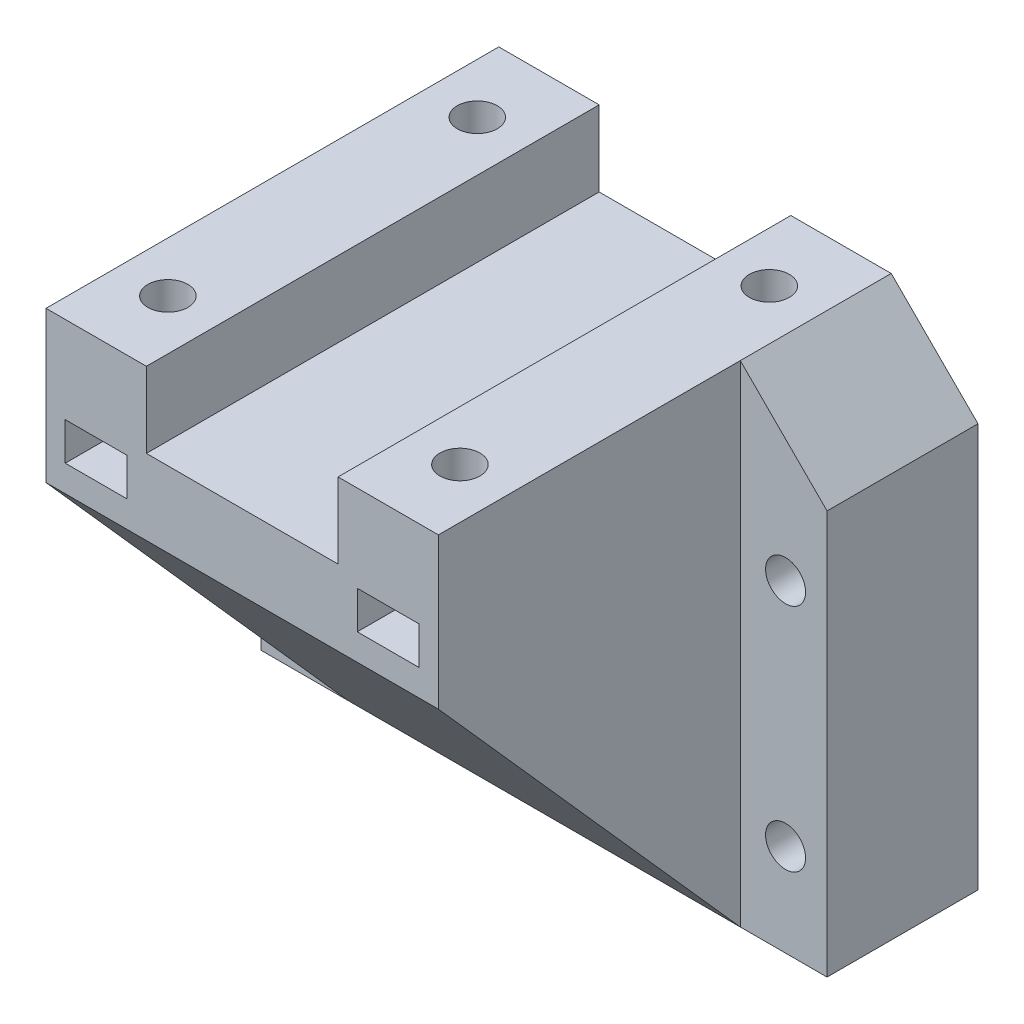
ISO-10303-21;
HEADER;
FILE_DESCRIPTION(('STEP AP214'),'2;1');
FILE_NAME('part.step','',(''),(''),'','','');
FILE_SCHEMA(('AUTOMOTIVE_DESIGN { 1 0 10303 214 1 1 1 1 }'));
ENDSEC;
DATA;
#1=APPLICATION_CONTEXT('core data for automotive mechanical design processes');
#2=APPLICATION_PROTOCOL_DEFINITION('international standard','automotive_design',2000,#1);
#3=PRODUCT_CONTEXT('',#1,'mechanical');
#4=PRODUCT('Part','Part','',(#3));
#5=PRODUCT_RELATED_PRODUCT_CATEGORY('part','',(#4));
#6=PRODUCT_DEFINITION_FORMATION('','',#4);
#7=PRODUCT_DEFINITION_CONTEXT('part definition',#1,'design');
#8=PRODUCT_DEFINITION('design','',#6,#7);
#9=PRODUCT_DEFINITION_SHAPE('','',#8);
#10=(LENGTH_UNIT() NAMED_UNIT(*) SI_UNIT(.MILLI.,.METRE.));
#11=(NAMED_UNIT(*) PLANE_ANGLE_UNIT() SI_UNIT($,.RADIAN.));
#12=(NAMED_UNIT(*) SI_UNIT($,.STERADIAN.) SOLID_ANGLE_UNIT());
#13=UNCERTAINTY_MEASURE_WITH_UNIT(LENGTH_MEASURE(1.E-05),#10,'distance_accuracy_value','');
#14=(GEOMETRIC_REPRESENTATION_CONTEXT(3) GLOBAL_UNCERTAINTY_ASSIGNED_CONTEXT((#13)) GLOBAL_UNIT_ASSIGNED_CONTEXT((#10,
#11,#12)) REPRESENTATION_CONTEXT('',''));
#15=CARTESIAN_POINT('',(0.,0.,0.));
#16=DIRECTION('',(0.,0.,1.));
#17=DIRECTION('',(1.,0.,0.));
#18=AXIS2_PLACEMENT_3D('',#15,#16,#17);
#19=CARTESIAN_POINT('',(0.,0.,13.));
#20=DIRECTION('',(0.,0.,1.));
#21=DIRECTION('',(1.,0.,0.));
#22=AXIS2_PLACEMENT_3D('',#19,#20,#21);
#23=PLANE('',#22);
#24=DIRECTION('',(0.,1.,0.));
#25=VECTOR('',#24,1.);
#26=CARTESIAN_POINT('',(17.212177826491,0.,13.));
#27=LINE('',#26,#25);
#28=CARTESIAN_POINT('',(17.2121778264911,21.,13.));
#29=VERTEX_POINT('',#28);
#30=CARTESIAN_POINT('',(17.2121778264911,25.2,13.));
#31=VERTEX_POINT('',#30);
#32=EDGE_CURVE('E677',#29,#31,#27,.T.);
#33=ORIENTED_EDGE('',*,*,#32,.F.);
#34=DIRECTION('',(-1.,0.,0.));
#35=VECTOR('',#34,1.);
#36=CARTESIAN_POINT('',(15.25,21.,13.));
#37=LINE('',#36,#35);
#38=CARTESIAN_POINT('',(15.25,21.,13.));
#39=VERTEX_POINT('',#38);
#40=EDGE_CURVE('E433',#29,#39,#37,.T.);
#41=ORIENTED_EDGE('',*,*,#40,.T.);
#42=DIRECTION('',(0.,1.,0.));
#43=VECTOR('',#42,1.);
#44=CARTESIAN_POINT('',(15.25,26.,13.));
#45=LINE('',#44,#43);
#46=CARTESIAN_POINT('',(15.25,26.,13.));
#47=VERTEX_POINT('',#46);
#48=EDGE_CURVE('E438',#39,#47,#45,.T.);
#49=ORIENTED_EDGE('',*,*,#48,.T.);
#50=DIRECTION('',(1.,0.,0.));
#51=VECTOR('',#50,1.);
#52=CARTESIAN_POINT('',(15.25,26.,13.));
#53=LINE('',#52,#51);
#54=CARTESIAN_POINT('',(23.45,26.,13.));
#55=VERTEX_POINT('',#54);
#56=EDGE_CURVE('E441',#47,#55,#53,.T.);
#57=ORIENTED_EDGE('',*,*,#56,.T.);
#58=DIRECTION('',(0.,-1.,0.));
#59=VECTOR('',#58,1.);
#60=CARTESIAN_POINT('',(23.45,26.,13.));
#61=LINE('',#60,#59);
#62=CARTESIAN_POINT('',(23.45,21.,13.));
#63=VERTEX_POINT('',#62);
#64=EDGE_CURVE('E430',#55,#63,#61,.T.);
#65=ORIENTED_EDGE('',*,*,#64,.T.);
#66=CARTESIAN_POINT('',(21.4878221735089,21.,13.));
#67=VERTEX_POINT('',#66);
#68=EDGE_CURVE('E435',#63,#67,#37,.T.);
#69=ORIENTED_EDGE('',*,*,#68,.T.);
#70=DIRECTION('',(0.,-1.,0.));
#71=VECTOR('',#70,1.);
#72=CARTESIAN_POINT('',(21.4878221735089,0.,13.));
#73=LINE('',#72,#71);
#74=CARTESIAN_POINT('',(21.4878221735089,25.2,13.));
#75=VERTEX_POINT('',#74);
#76=EDGE_CURVE('E674',#75,#67,#73,.T.);
#77=ORIENTED_EDGE('',*,*,#76,.F.);
#78=DIRECTION('',(-1.,0.,0.));
#79=VECTOR('',#78,1.);
#80=CARTESIAN_POINT('',(0.,25.2,13.));
#81=LINE('',#80,#79);
#82=EDGE_CURVE('E671',#75,#31,#81,.T.);
#83=ORIENTED_EDGE('',*,*,#82,.T.);
#84=EDGE_LOOP('',(#33,#41,#49,#57,#65,#69,#77,#83));
#85=FACE_BOUND('',#84,.T.);
#86=ADVANCED_FACE('F37',(#85),#23,.F.);
#87=CARTESIAN_POINT('',(0.,0.,13.));
#88=DIRECTION('',(0.,0.,-1.));
#89=DIRECTION('',(-1.,0.,0.));
#90=AXIS2_PLACEMENT_3D('',#87,#88,#89);
#91=PLANE('',#90);
#92=DIRECTION('',(-1.,0.,0.));
#93=VECTOR('',#92,1.);
#94=CARTESIAN_POINT('',(0.,25.2,13.));
#95=LINE('',#94,#93);
#96=CARTESIAN_POINT('',(-17.2121778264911,25.2,13.));
#97=VERTEX_POINT('',#96);
#98=CARTESIAN_POINT('',(-21.4878221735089,25.2,13.));
#99=VERTEX_POINT('',#98);
#100=EDGE_CURVE('E662',#97,#99,#95,.T.);
#101=ORIENTED_EDGE('',*,*,#100,.T.);
#102=DIRECTION('',(0.,-1.,0.));
#103=VECTOR('',#102,1.);
#104=CARTESIAN_POINT('',(-21.4878221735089,0.,13.));
#105=LINE('',#104,#103);
#106=CARTESIAN_POINT('',(-21.4878221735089,21.,13.));
#107=VERTEX_POINT('',#106);
#108=EDGE_CURVE('E668',#99,#107,#105,.T.);
#109=ORIENTED_EDGE('',*,*,#108,.T.);
#110=DIRECTION('',(-1.,0.,0.));
#111=VECTOR('',#110,1.);
#112=CARTESIAN_POINT('',(-15.25,21.,13.));
#113=LINE('',#112,#111);
#114=CARTESIAN_POINT('',(-23.45,21.,13.));
#115=VERTEX_POINT('',#114);
#116=EDGE_CURVE('E468',#107,#115,#113,.T.);
#117=ORIENTED_EDGE('',*,*,#116,.T.);
#118=DIRECTION('',(0.,1.,0.));
#119=VECTOR('',#118,1.);
#120=CARTESIAN_POINT('',(-23.45,26.,13.));
#121=LINE('',#120,#119);
#122=CARTESIAN_POINT('',(-23.45,26.,13.));
#123=VERTEX_POINT('',#122);
#124=EDGE_CURVE('E473',#115,#123,#121,.T.);
#125=ORIENTED_EDGE('',*,*,#124,.T.);
#126=DIRECTION('',(1.,0.,0.));
#127=VECTOR('',#126,1.);
#128=CARTESIAN_POINT('',(-15.25,26.,13.));
#129=LINE('',#128,#127);
#130=CARTESIAN_POINT('',(-15.25,26.,13.));
#131=VERTEX_POINT('',#130);
#132=EDGE_CURVE('E476',#123,#131,#129,.T.);
#133=ORIENTED_EDGE('',*,*,#132,.T.);
#134=DIRECTION('',(0.,-1.,0.));
#135=VECTOR('',#134,1.);
#136=CARTESIAN_POINT('',(-15.25,26.,13.));
#137=LINE('',#136,#135);
#138=CARTESIAN_POINT('',(-15.25,21.,13.));
#139=VERTEX_POINT('',#138);
#140=EDGE_CURVE('E465',#131,#139,#137,.T.);
#141=ORIENTED_EDGE('',*,*,#140,.T.);
#142=CARTESIAN_POINT('',(-17.2121778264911,21.,13.));
#143=VERTEX_POINT('',#142);
#144=EDGE_CURVE('E470',#139,#143,#113,.T.);
#145=ORIENTED_EDGE('',*,*,#144,.T.);
#146=DIRECTION('',(0.,1.,0.));
#147=VECTOR('',#146,1.);
#148=CARTESIAN_POINT('',(-17.2121778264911,0.,13.));
#149=LINE('',#148,#147);
#150=EDGE_CURVE('E665',#143,#97,#149,.T.);
#151=ORIENTED_EDGE('',*,*,#150,.T.);
#152=EDGE_LOOP('',(#101,#109,#117,#125,#133,#141,#145,#151));
#153=FACE_BOUND('',#152,.T.);
#154=ADVANCED_FACE('F770',(#153),#91,.T.);
#155=CARTESIAN_POINT('',(0.,0.,47.));
#156=DIRECTION('',(0.,0.,-1.));
#157=DIRECTION('',(-1.,0.,0.));
#158=AXIS2_PLACEMENT_3D('',#155,#156,#157);
#159=PLANE('',#158);
#160=DIRECTION('',(0.,1.,0.));
#161=VECTOR('',#160,1.);
#162=CARTESIAN_POINT('',(21.4878221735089,0.,47.));
#163=LINE('',#162,#161);
#164=CARTESIAN_POINT('',(21.4878221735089,21.,47.));
#165=VERTEX_POINT('',#164);
#166=CARTESIAN_POINT('',(21.4878221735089,25.2,47.));
#167=VERTEX_POINT('',#166);
#168=EDGE_CURVE('E307',#165,#167,#163,.T.);
#169=ORIENTED_EDGE('',*,*,#168,.F.);
#170=DIRECTION('',(1.,0.,0.));
#171=VECTOR('',#170,1.);
#172=CARTESIAN_POINT('',(23.45,21.,47.));
#173=LINE('',#172,#171);
#174=CARTESIAN_POINT('',(23.45,21.,47.));
#175=VERTEX_POINT('',#174);
#176=EDGE_CURVE('E367',#165,#175,#173,.T.);
#177=ORIENTED_EDGE('',*,*,#176,.T.);
#178=DIRECTION('',(0.,1.,0.));
#179=VECTOR('',#178,1.);
#180=CARTESIAN_POINT('',(23.45,26.,47.));
#181=LINE('',#180,#179);
#182=CARTESIAN_POINT('',(23.45,26.,47.));
#183=VERTEX_POINT('',#182);
#184=EDGE_CURVE('E372',#175,#183,#181,.T.);
#185=ORIENTED_EDGE('',*,*,#184,.T.);
#186=DIRECTION('',(-1.,0.,0.));
#187=VECTOR('',#186,1.);
#188=CARTESIAN_POINT('',(15.25,26.,47.));
#189=LINE('',#188,#187);
#190=CARTESIAN_POINT('',(15.25,26.,47.));
#191=VERTEX_POINT('',#190);
#192=EDGE_CURVE('E375',#183,#191,#189,.T.);
#193=ORIENTED_EDGE('',*,*,#192,.T.);
#194=DIRECTION('',(0.,-1.,0.));
#195=VECTOR('',#194,1.);
#196=CARTESIAN_POINT('',(15.25,21.,47.));
#197=LINE('',#196,#195);
#198=CARTESIAN_POINT('',(15.25,21.,47.));
#199=VERTEX_POINT('',#198);
#200=EDGE_CURVE('E364',#191,#199,#197,.T.);
#201=ORIENTED_EDGE('',*,*,#200,.T.);
#202=CARTESIAN_POINT('',(17.2121778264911,21.,47.));
#203=VERTEX_POINT('',#202);
#204=EDGE_CURVE('E369',#199,#203,#173,.T.);
#205=ORIENTED_EDGE('',*,*,#204,.T.);
#206=DIRECTION('',(0.,-1.,0.));
#207=VECTOR('',#206,1.);
#208=CARTESIAN_POINT('',(17.2121778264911,0.,47.));
#209=LINE('',#208,#207);
#210=CARTESIAN_POINT('',(17.2121778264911,25.2,47.));
#211=VERTEX_POINT('',#210);
#212=EDGE_CURVE('E659',#211,#203,#209,.T.);
#213=ORIENTED_EDGE('',*,*,#212,.F.);
#214=DIRECTION('',(1.,0.,0.));
#215=VECTOR('',#214,1.);
#216=CARTESIAN_POINT('',(0.,25.2,47.));
#217=LINE('',#216,#215);
#218=EDGE_CURVE('E322',#211,#167,#217,.T.);
#219=ORIENTED_EDGE('',*,*,#218,.T.);
#220=EDGE_LOOP('',(#169,#177,#185,#193,#201,#205,#213,#219));
#221=FACE_BOUND('',#220,.T.);
#222=ADVANCED_FACE('F776',(#221),#159,.F.);
#223=CARTESIAN_POINT('',(0.,0.,47.));
#224=DIRECTION('',(0.,0.,-1.));
#225=DIRECTION('',(-1.,0.,0.));
#226=AXIS2_PLACEMENT_3D('',#223,#224,#225);
#227=PLANE('',#226);
#228=DIRECTION('',(0.,1.,0.));
#229=VECTOR('',#228,1.);
#230=CARTESIAN_POINT('',(-17.2121778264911,0.,47.));
#231=LINE('',#230,#229);
#232=CARTESIAN_POINT('',(-17.2121778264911,21.,47.));
#233=VERTEX_POINT('',#232);
#234=CARTESIAN_POINT('',(-17.2121778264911,25.2,47.));
#235=VERTEX_POINT('',#234);
#236=EDGE_CURVE('E656',#233,#235,#231,.T.);
#237=ORIENTED_EDGE('',*,*,#236,.F.);
#238=DIRECTION('',(1.,0.,0.));
#239=VECTOR('',#238,1.);
#240=CARTESIAN_POINT('',(-15.25,21.,47.));
#241=LINE('',#240,#239);
#242=CARTESIAN_POINT('',(-15.25,21.,47.));
#243=VERTEX_POINT('',#242);
#244=EDGE_CURVE('E403',#233,#243,#241,.T.);
#245=ORIENTED_EDGE('',*,*,#244,.T.);
#246=DIRECTION('',(0.,1.,0.));
#247=VECTOR('',#246,1.);
#248=CARTESIAN_POINT('',(-15.25,26.,47.));
#249=LINE('',#248,#247);
#250=CARTESIAN_POINT('',(-15.25,26.,47.));
#251=VERTEX_POINT('',#250);
#252=EDGE_CURVE('E402',#243,#251,#249,.T.);
#253=ORIENTED_EDGE('',*,*,#252,.T.);
#254=DIRECTION('',(-1.,0.,0.));
#255=VECTOR('',#254,1.);
#256=CARTESIAN_POINT('',(-23.45,26.,47.));
#257=LINE('',#256,#255);
#258=CARTESIAN_POINT('',(-23.45,26.,47.));
#259=VERTEX_POINT('',#258);
#260=EDGE_CURVE('E406',#251,#259,#257,.T.);
#261=ORIENTED_EDGE('',*,*,#260,.T.);
#262=DIRECTION('',(0.,-1.,0.));
#263=VECTOR('',#262,1.);
#264=CARTESIAN_POINT('',(-23.45,21.,47.));
#265=LINE('',#264,#263);
#266=CARTESIAN_POINT('',(-23.45,21.,47.));
#267=VERTEX_POINT('',#266);
#268=EDGE_CURVE('E409',#259,#267,#265,.T.);
#269=ORIENTED_EDGE('',*,*,#268,.T.);
#270=CARTESIAN_POINT('',(-21.4878221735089,21.,47.));
#271=VERTEX_POINT('',#270);
#272=EDGE_CURVE('E399',#267,#271,#241,.T.);
#273=ORIENTED_EDGE('',*,*,#272,.T.);
#274=DIRECTION('',(0.,-1.,0.));
#275=VECTOR('',#274,1.);
#276=CARTESIAN_POINT('',(-21.4878221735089,0.,47.));
#277=LINE('',#276,#275);
#278=CARTESIAN_POINT('',(-21.4878221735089,25.2,47.));
#279=VERTEX_POINT('',#278);
#280=EDGE_CURVE('E653',#279,#271,#277,.T.);
#281=ORIENTED_EDGE('',*,*,#280,.F.);
#282=DIRECTION('',(-1.,0.,0.));
#283=VECTOR('',#282,1.);
#284=CARTESIAN_POINT('',(0.,25.2,47.));
#285=LINE('',#284,#283);
#286=EDGE_CURVE('E631',#235,#279,#285,.T.);
#287=ORIENTED_EDGE('',*,*,#286,.F.);
#288=EDGE_LOOP('',(#237,#245,#253,#261,#269,#273,#281,#287));
#289=FACE_BOUND('',#288,.T.);
#290=ADVANCED_FACE('F945',(#289),#227,.F.);
#291=CARTESIAN_POINT('',(19.35,15.5,50.5));
#292=DIRECTION('',(0.,1.,0.));
#293=DIRECTION('',(-1.,0.,0.));
#294=AXIS2_PLACEMENT_3D('',#291,#292,#293);
#295=CYLINDRICAL_SURFACE('',#294,2.65);
#296=CARTESIAN_POINT('',(19.35,26.,50.5));
#297=DIRECTION('',(0.,1.,0.));
#298=DIRECTION('',(0.,0.,1.));
#299=AXIS2_PLACEMENT_3D('',#296,#297,#298);
#300=CIRCLE('',#299,2.65);
#301=CARTESIAN_POINT('',(19.35,26.,53.15));
#302=VERTEX_POINT('',#301);
#303=EDGE_CURVE('E644',#302,#302,#300,.F.);
#304=ORIENTED_EDGE('',*,*,#303,.T.);
#305=EDGE_LOOP('',(#304));
#306=FACE_BOUND('',#305,.T.);
#307=CARTESIAN_POINT('',(19.35,37.5,50.5));
#308=DIRECTION('',(0.,1.,0.));
#309=DIRECTION('',(-1.,0.,0.));
#310=AXIS2_PLACEMENT_3D('',#307,#308,#309);
#311=CIRCLE('',#310,2.65);
#312=CARTESIAN_POINT('',(16.7,37.5,50.5));
#313=VERTEX_POINT('',#312);
#314=EDGE_CURVE('E501',#313,#313,#311,.T.);
#315=ORIENTED_EDGE('',*,*,#314,.T.);
#316=EDGE_LOOP('',(#315));
#317=FACE_BOUND('',#316,.T.);
#318=ADVANCED_FACE('F850',(#306,#317),#295,.F.);
#319=CARTESIAN_POINT('',(-19.35,15.5,9.5));
#320=DIRECTION('',(0.,1.,0.));
#321=DIRECTION('',(-1.,0.,0.));
#322=AXIS2_PLACEMENT_3D('',#319,#320,#321);
#323=CYLINDRICAL_SURFACE('',#322,2.65);
#324=CARTESIAN_POINT('',(-19.35,26.,9.5));
#325=DIRECTION('',(0.,1.,0.));
#326=DIRECTION('',(-1.,0.,0.));
#327=AXIS2_PLACEMENT_3D('',#324,#325,#326);
#328=CIRCLE('',#327,2.65);
#329=CARTESIAN_POINT('',(-22.,26.,9.5));
#330=VERTEX_POINT('',#329);
#331=EDGE_CURVE('E517',#330,#330,#328,.F.);
#332=ORIENTED_EDGE('',*,*,#331,.T.);
#333=EDGE_LOOP('',(#332));
#334=FACE_BOUND('',#333,.T.);
#335=CARTESIAN_POINT('',(-19.35,37.5,9.5));
#336=DIRECTION('',(0.,1.,0.));
#337=DIRECTION('',(1.,0.,0.));
#338=AXIS2_PLACEMENT_3D('',#335,#336,#337);
#339=CIRCLE('',#338,2.65);
#340=CARTESIAN_POINT('',(-16.7,37.5,9.5));
#341=VERTEX_POINT('',#340);
#342=EDGE_CURVE('E508',#341,#341,#339,.T.);
#343=ORIENTED_EDGE('',*,*,#342,.T.);
#344=EDGE_LOOP('',(#343));
#345=FACE_BOUND('',#344,.T.);
#346=ADVANCED_FACE('F763',(#334,#345),#323,.F.);
#347=CARTESIAN_POINT('',(19.35,15.5,9.5));
#348=DIRECTION('',(0.,1.,0.));
#349=DIRECTION('',(-1.,0.,0.));
#350=AXIS2_PLACEMENT_3D('',#347,#348,#349);
#351=CYLINDRICAL_SURFACE('',#350,2.65);
#352=CARTESIAN_POINT('',(19.35,26.,9.5));
#353=DIRECTION('',(0.,1.,0.));
#354=DIRECTION('',(0.,0.,1.));
#355=AXIS2_PLACEMENT_3D('',#352,#353,#354);
#356=CIRCLE('',#355,2.65);
#357=CARTESIAN_POINT('',(19.35,26.,12.15));
#358=VERTEX_POINT('',#357);
#359=EDGE_CURVE('E634',#358,#358,#356,.F.);
#360=ORIENTED_EDGE('',*,*,#359,.T.);
#361=EDGE_LOOP('',(#360));
#362=FACE_BOUND('',#361,.T.);
#363=CARTESIAN_POINT('',(19.35,37.5,9.5));
#364=DIRECTION('',(0.,1.,0.));
#365=DIRECTION('',(-1.,0.,0.));
#366=AXIS2_PLACEMENT_3D('',#363,#364,#365);
#367=CIRCLE('',#366,2.65);
#368=CARTESIAN_POINT('',(16.7,37.5,9.5));
#369=VERTEX_POINT('',#368);
#370=EDGE_CURVE('E502',#369,#369,#367,.T.);
#371=ORIENTED_EDGE('',*,*,#370,.T.);
#372=EDGE_LOOP('',(#371));
#373=FACE_BOUND('',#372,.T.);
#374=ADVANCED_FACE('F754',(#362,#373),#351,.F.);
#375=CARTESIAN_POINT('',(37.5,27.5,20.));
#376=DIRECTION('',(0.,-1.,0.));
#377=DIRECTION('',(1.,0.,0.));
#378=AXIS2_PLACEMENT_3D('',#375,#376,#377);
#379=PLANE('',#378);
#380=DIRECTION('',(0.,0.,-1.));
#381=VECTOR('',#380,1.);
#382=CARTESIAN_POINT('',(-12.7,27.5,60.));
#383=LINE('',#382,#381);
#384=CARTESIAN_POINT('',(-12.7,27.5,60.));
#385=VERTEX_POINT('',#384);
#386=CARTESIAN_POINT('',(-12.7,27.5,0.));
#387=VERTEX_POINT('',#386);
#388=EDGE_CURVE('E521',#385,#387,#383,.T.);
#389=ORIENTED_EDGE('',*,*,#388,.F.);
#390=DIRECTION('',(-1.,0.,0.));
#391=VECTOR('',#390,1.);
#392=CARTESIAN_POINT('',(26.,27.5,60.));
#393=LINE('',#392,#391);
#394=CARTESIAN_POINT('',(12.7,27.5,60.));
#395=VERTEX_POINT('',#394);
#396=EDGE_CURVE('E574',#395,#385,#393,.T.);
#397=ORIENTED_EDGE('',*,*,#396,.F.);
#398=DIRECTION('',(0.,0.,1.));
#399=VECTOR('',#398,1.);
#400=CARTESIAN_POINT('',(12.7,27.5,60.));
#401=LINE('',#400,#399);
#402=CARTESIAN_POINT('',(12.7,27.5,0.));
#403=VERTEX_POINT('',#402);
#404=EDGE_CURVE('E540',#403,#395,#401,.T.);
#405=ORIENTED_EDGE('',*,*,#404,.F.);
#406=DIRECTION('',(-1.,0.,0.));
#407=VECTOR('',#406,1.);
#408=CARTESIAN_POINT('',(37.5,27.5,0.));
#409=LINE('',#408,#407);
#410=EDGE_CURVE('E609',#403,#387,#409,.T.);
#411=ORIENTED_EDGE('',*,*,#410,.T.);
#412=EDGE_LOOP('',(#389,#397,#405,#411));
#413=FACE_BOUND('',#412,.T.);
#414=ADVANCED_FACE('F752',(#413),#379,.F.);
#415=CARTESIAN_POINT('',(0.,0.,20.));
#416=DIRECTION('',(0.,0.,1.));
#417=DIRECTION('',(1.,0.,0.));
#418=AXIS2_PLACEMENT_3D('',#415,#416,#417);
#419=PLANE('',#418);
#420=DIRECTION('',(0.,-1.,0.));
#421=VECTOR('',#420,1.);
#422=CARTESIAN_POINT('',(-26.,27.5,20.));
#423=LINE('',#422,#421);
#424=CARTESIAN_POINT('',(-26.,37.5,20.));
#425=VERTEX_POINT('',#424);
#426=CARTESIAN_POINT('',(-26.,-27.5,20.));
#427=VERTEX_POINT('',#426);
#428=EDGE_CURVE('E567',#425,#427,#423,.T.);
#429=ORIENTED_EDGE('',*,*,#428,.F.);
#430=DIRECTION('',(-0.707106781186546,-0.707106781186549,0.));
#431=VECTOR('',#430,1.);
#432=CARTESIAN_POINT('',(-31.75,31.7499999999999,20.));
#433=LINE('',#432,#431);
#434=CARTESIAN_POINT('',(-37.5,26.,20.));
#435=VERTEX_POINT('',#434);
#436=EDGE_CURVE('E46',#425,#435,#433,.T.);
#437=ORIENTED_EDGE('',*,*,#436,.T.);
#438=DIRECTION('',(0.,-1.,0.));
#439=VECTOR('',#438,1.);
#440=CARTESIAN_POINT('',(-37.5,-27.5,20.));
#441=LINE('',#440,#439);
#442=CARTESIAN_POINT('',(-37.5,-27.5,20.));
#443=VERTEX_POINT('',#442);
#444=EDGE_CURVE('E606',#435,#443,#441,.T.);
#445=ORIENTED_EDGE('',*,*,#444,.T.);
#446=DIRECTION('',(1.,0.,0.));
#447=VECTOR('',#446,1.);
#448=CARTESIAN_POINT('',(37.5,-27.5,20.));
#449=LINE('',#448,#447);
#450=EDGE_CURVE('E610',#443,#427,#449,.T.);
#451=ORIENTED_EDGE('',*,*,#450,.T.);
#452=EDGE_LOOP('',(#429,#437,#445,#451));
#453=FACE_BOUND('',#452,.T.);
#454=CARTESIAN_POINT('',(-32.,-15.25,20.));
#455=DIRECTION('',(0.,0.,1.));
#456=DIRECTION('',(1.,0.,0.));
#457=AXIS2_PLACEMENT_3D('',#454,#455,#456);
#458=CIRCLE('',#457,2.65);
#459=CARTESIAN_POINT('',(-29.35,-15.25,20.));
#460=VERTEX_POINT('',#459);
#461=EDGE_CURVE('E582',#460,#460,#458,.T.);
#462=ORIENTED_EDGE('',*,*,#461,.F.);
#463=EDGE_LOOP('',(#462));
#464=FACE_BOUND('',#463,.T.);
#465=CARTESIAN_POINT('',(-32.,15.25,20.));
#466=DIRECTION('',(0.,0.,1.));
#467=DIRECTION('',(1.,0.,0.));
#468=AXIS2_PLACEMENT_3D('',#465,#466,#467);
#469=CIRCLE('',#468,2.65);
#470=CARTESIAN_POINT('',(-29.35,15.25,20.));
#471=VERTEX_POINT('',#470);
#472=EDGE_CURVE('E600',#471,#471,#469,.T.);
#473=ORIENTED_EDGE('',*,*,#472,.F.);
#474=EDGE_LOOP('',(#473));
#475=FACE_BOUND('',#474,.T.);
#476=ADVANCED_FACE('F699',(#453,#464,#475),#419,.T.);
#477=DIRECTION('',(0.,1.,0.));
#478=VECTOR('',#477,1.);
#479=CARTESIAN_POINT('',(37.5,-27.5,20.));
#480=LINE('',#479,#478);
#481=CARTESIAN_POINT('',(37.5,-27.5,20.));
#482=VERTEX_POINT('',#481);
#483=CARTESIAN_POINT('',(37.5,26.,20.));
#484=VERTEX_POINT('',#483);
#485=EDGE_CURVE('E613',#482,#484,#480,.T.);
#486=ORIENTED_EDGE('',*,*,#485,.T.);
#487=DIRECTION('',(0.707106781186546,-0.707106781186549,0.));
#488=VECTOR('',#487,1.);
#489=CARTESIAN_POINT('',(31.7500000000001,31.7499999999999,20.));
#490=LINE('',#489,#488);
#491=CARTESIAN_POINT('',(26.,37.5,20.));
#492=VERTEX_POINT('',#491);
#493=EDGE_CURVE('E687',#484,#492,#490,.F.);
#494=ORIENTED_EDGE('',*,*,#493,.T.);
#495=DIRECTION('',(0.,1.,0.));
#496=VECTOR('',#495,1.);
#497=CARTESIAN_POINT('',(26.,27.5,20.));
#498=LINE('',#497,#496);
#499=CARTESIAN_POINT('',(26.,-27.5,20.));
#500=VERTEX_POINT('',#499);
#501=EDGE_CURVE('E572',#500,#492,#498,.T.);
#502=ORIENTED_EDGE('',*,*,#501,.F.);
#503=EDGE_CURVE('E608',#500,#482,#449,.T.);
#504=ORIENTED_EDGE('',*,*,#503,.T.);
#505=EDGE_LOOP('',(#486,#494,#502,#504));
#506=FACE_BOUND('',#505,.T.);
#507=CARTESIAN_POINT('',(32.,-15.25,20.));
#508=DIRECTION('',(0.,0.,1.));
#509=DIRECTION('',(1.,0.,0.));
#510=AXIS2_PLACEMENT_3D('',#507,#508,#509);
#511=CIRCLE('',#510,2.65);
#512=CARTESIAN_POINT('',(34.65,-15.25,20.));
#513=VERTEX_POINT('',#512);
#514=EDGE_CURVE('E588',#513,#513,#511,.T.);
#515=ORIENTED_EDGE('',*,*,#514,.F.);
#516=EDGE_LOOP('',(#515));
#517=FACE_BOUND('',#516,.T.);
#518=CARTESIAN_POINT('',(32.,15.25,20.));
#519=DIRECTION('',(0.,0.,1.));
#520=DIRECTION('',(1.,0.,0.));
#521=AXIS2_PLACEMENT_3D('',#518,#519,#520);
#522=CIRCLE('',#521,2.65);
#523=CARTESIAN_POINT('',(34.65,15.25,20.));
#524=VERTEX_POINT('',#523);
#525=EDGE_CURVE('E594',#524,#524,#522,.T.);
#526=ORIENTED_EDGE('',*,*,#525,.F.);
#527=EDGE_LOOP('',(#526));
#528=FACE_BOUND('',#527,.T.);
#529=ADVANCED_FACE('F736',(#506,#517,#528),#419,.T.);
#530=CARTESIAN_POINT('',(0.,0.,0.));
#531=DIRECTION('',(0.,0.,1.));
#532=DIRECTION('',(1.,0.,0.));
#533=AXIS2_PLACEMENT_3D('',#530,#531,#532);
#534=PLANE('',#533);
#535=DIRECTION('',(-1.,0.,0.));
#536=VECTOR('',#535,1.);
#537=CARTESIAN_POINT('',(15.25,21.,0.));
#538=LINE('',#537,#536);
#539=CARTESIAN_POINT('',(23.45,21.,0.));
#540=VERTEX_POINT('',#539);
#541=CARTESIAN_POINT('',(15.25,21.,0.));
#542=VERTEX_POINT('',#541);
#543=EDGE_CURVE('E448',#540,#542,#538,.T.);
#544=ORIENTED_EDGE('',*,*,#543,.F.);
#545=DIRECTION('',(0.,-1.,0.));
#546=VECTOR('',#545,1.);
#547=CARTESIAN_POINT('',(23.45,26.,0.));
#548=LINE('',#547,#546);
#549=CARTESIAN_POINT('',(23.45,26.,0.));
#550=VERTEX_POINT('',#549);
#551=EDGE_CURVE('E445',#550,#540,#548,.T.);
#552=ORIENTED_EDGE('',*,*,#551,.F.);
#553=DIRECTION('',(1.,0.,0.));
#554=VECTOR('',#553,1.);
#555=CARTESIAN_POINT('',(15.25,26.,0.));
#556=LINE('',#555,#554);
#557=CARTESIAN_POINT('',(15.25,26.,0.));
#558=VERTEX_POINT('',#557);
#559=EDGE_CURVE('E434',#558,#550,#556,.T.);
#560=ORIENTED_EDGE('',*,*,#559,.F.);
#561=DIRECTION('',(0.,1.,0.));
#562=VECTOR('',#561,1.);
#563=CARTESIAN_POINT('',(15.25,26.,0.));
#564=LINE('',#563,#562);
#565=EDGE_CURVE('E452',#542,#558,#564,.T.);
#566=ORIENTED_EDGE('',*,*,#565,.F.);
#567=EDGE_LOOP('',(#544,#552,#560,#566));
#568=FACE_BOUND('',#567,.T.);
#569=DIRECTION('',(-1.,0.,0.));
#570=VECTOR('',#569,1.);
#571=CARTESIAN_POINT('',(-15.25,21.,0.));
#572=LINE('',#571,#570);
#573=CARTESIAN_POINT('',(-15.25,21.,0.));
#574=VERTEX_POINT('',#573);
#575=CARTESIAN_POINT('',(-23.45,21.,0.));
#576=VERTEX_POINT('',#575);
#577=EDGE_CURVE('E483',#574,#576,#572,.T.);
#578=ORIENTED_EDGE('',*,*,#577,.F.);
#579=DIRECTION('',(0.,-1.,0.));
#580=VECTOR('',#579,1.);
#581=CARTESIAN_POINT('',(-15.25,26.,0.));
#582=LINE('',#581,#580);
#583=CARTESIAN_POINT('',(-15.25,26.,0.));
#584=VERTEX_POINT('',#583);
#585=EDGE_CURVE('E480',#584,#574,#582,.T.);
#586=ORIENTED_EDGE('',*,*,#585,.F.);
#587=DIRECTION('',(1.,0.,0.));
#588=VECTOR('',#587,1.);
#589=CARTESIAN_POINT('',(-15.25,26.,0.));
#590=LINE('',#589,#588);
#591=CARTESIAN_POINT('',(-23.45,26.,0.));
#592=VERTEX_POINT('',#591);
#593=EDGE_CURVE('E469',#592,#584,#590,.T.);
#594=ORIENTED_EDGE('',*,*,#593,.F.);
#595=DIRECTION('',(0.,1.,0.));
#596=VECTOR('',#595,1.);
#597=CARTESIAN_POINT('',(-23.45,26.,0.));
#598=LINE('',#597,#596);
#599=EDGE_CURVE('E487',#576,#592,#598,.T.);
#600=ORIENTED_EDGE('',*,*,#599,.F.);
#601=EDGE_LOOP('',(#578,#586,#594,#600));
#602=FACE_BOUND('',#601,.T.);
#603=DIRECTION('',(-1.,0.,0.));
#604=VECTOR('',#603,1.);
#605=CARTESIAN_POINT('',(12.7,37.5,0.));
#606=LINE('',#605,#604);
#607=CARTESIAN_POINT('',(26.,37.5,0.));
#608=VERTEX_POINT('',#607);
#609=CARTESIAN_POINT('',(12.7,37.5,0.));
#610=VERTEX_POINT('',#609);
#611=EDGE_CURVE('E541',#608,#610,#606,.T.);
#612=ORIENTED_EDGE('',*,*,#611,.F.);
#613=DIRECTION('',(-0.707106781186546,0.707106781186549,0.));
#614=VECTOR('',#613,1.);
#615=CARTESIAN_POINT('',(26.,37.5,0.));
#616=LINE('',#615,#614);
#617=CARTESIAN_POINT('',(37.5,26.,0.));
#618=VERTEX_POINT('',#617);
#619=EDGE_CURVE('E684',#608,#618,#616,.F.);
#620=ORIENTED_EDGE('',*,*,#619,.T.);
#621=DIRECTION('',(0.,1.,0.));
#622=VECTOR('',#621,1.);
#623=CARTESIAN_POINT('',(37.5,-27.5,0.));
#624=LINE('',#623,#622);
#625=CARTESIAN_POINT('',(37.5,-27.5,0.));
#626=VERTEX_POINT('',#625);
#627=EDGE_CURVE('E619',#626,#618,#624,.T.);
#628=ORIENTED_EDGE('',*,*,#627,.F.);
#629=DIRECTION('',(1.,0.,0.));
#630=VECTOR('',#629,1.);
#631=CARTESIAN_POINT('',(37.5,-27.5,0.));
#632=LINE('',#631,#630);
#633=CARTESIAN_POINT('',(-37.5,-27.5,0.));
#634=VERTEX_POINT('',#633);
#635=EDGE_CURVE('E617',#634,#626,#632,.T.);
#636=ORIENTED_EDGE('',*,*,#635,.F.);
#637=DIRECTION('',(0.,-1.,0.));
#638=VECTOR('',#637,1.);
#639=CARTESIAN_POINT('',(-37.5,-27.5,0.));
#640=LINE('',#639,#638);
#641=CARTESIAN_POINT('',(-37.5,26.,0.));
#642=VERTEX_POINT('',#641);
#643=EDGE_CURVE('E603',#642,#634,#640,.T.);
#644=ORIENTED_EDGE('',*,*,#643,.F.);
#645=DIRECTION('',(0.707106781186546,0.707106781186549,0.));
#646=VECTOR('',#645,1.);
#647=CARTESIAN_POINT('',(-26.,37.5,0.));
#648=LINE('',#647,#646);
#649=CARTESIAN_POINT('',(-26.,37.5,0.));
#650=VERTEX_POINT('',#649);
#651=EDGE_CURVE('E682',#642,#650,#648,.T.);
#652=ORIENTED_EDGE('',*,*,#651,.T.);
#653=DIRECTION('',(-1.,0.,0.));
#654=VECTOR('',#653,1.);
#655=CARTESIAN_POINT('',(-37.5,37.5,0.));
#656=LINE('',#655,#654);
#657=CARTESIAN_POINT('',(-12.7,37.5,0.));
#658=VERTEX_POINT('',#657);
#659=EDGE_CURVE('E531',#658,#650,#656,.T.);
#660=ORIENTED_EDGE('',*,*,#659,.F.);
#661=DIRECTION('',(0.,-1.,0.));
#662=VECTOR('',#661,1.);
#663=CARTESIAN_POINT('',(-12.7,37.5,0.));
#664=LINE('',#663,#662);
#665=EDGE_CURVE('E534',#658,#387,#664,.T.);
#666=ORIENTED_EDGE('',*,*,#665,.T.);
#667=ORIENTED_EDGE('',*,*,#410,.F.);
#668=DIRECTION('',(0.,-1.,0.));
#669=VECTOR('',#668,1.);
#670=CARTESIAN_POINT('',(12.7,37.5,0.));
#671=LINE('',#670,#669);
#672=EDGE_CURVE('E556',#610,#403,#671,.T.);
#673=ORIENTED_EDGE('',*,*,#672,.F.);
#674=EDGE_LOOP('',(#612,#620,#628,#636,#644,#652,#660,#666,#667,#673));
#675=FACE_BOUND('',#674,.T.);
#676=CARTESIAN_POINT('',(-32.,15.25,0.));
#677=DIRECTION('',(0.,0.,1.));
#678=DIRECTION('',(1.,0.,0.));
#679=AXIS2_PLACEMENT_3D('',#676,#677,#678);
#680=CIRCLE('',#679,2.65);
#681=CARTESIAN_POINT('',(-29.35,15.25,0.));
#682=VERTEX_POINT('',#681);
#683=EDGE_CURVE('E597',#682,#682,#680,.T.);
#684=ORIENTED_EDGE('',*,*,#683,.T.);
#685=EDGE_LOOP('',(#684));
#686=FACE_BOUND('',#685,.T.);
#687=CARTESIAN_POINT('',(32.,15.25,0.));
#688=DIRECTION('',(0.,0.,1.));
#689=DIRECTION('',(1.,0.,0.));
#690=AXIS2_PLACEMENT_3D('',#687,#688,#689);
#691=CIRCLE('',#690,2.65);
#692=CARTESIAN_POINT('',(34.65,15.25,0.));
#693=VERTEX_POINT('',#692);
#694=EDGE_CURVE('E591',#693,#693,#691,.T.);
#695=ORIENTED_EDGE('',*,*,#694,.T.);
#696=EDGE_LOOP('',(#695));
#697=FACE_BOUND('',#696,.T.);
#698=CARTESIAN_POINT('',(32.,-15.25,0.));
#699=DIRECTION('',(0.,0.,1.));
#700=DIRECTION('',(1.,0.,0.));
#701=AXIS2_PLACEMENT_3D('',#698,#699,#700);
#702=CIRCLE('',#701,2.65);
#703=CARTESIAN_POINT('',(34.65,-15.25,0.));
#704=VERTEX_POINT('',#703);
#705=EDGE_CURVE('E585',#704,#704,#702,.T.);
#706=ORIENTED_EDGE('',*,*,#705,.T.);
#707=EDGE_LOOP('',(#706));
#708=FACE_BOUND('',#707,.T.);
#709=CARTESIAN_POINT('',(-32.,-15.25,0.));
#710=DIRECTION('',(0.,0.,1.));
#711=DIRECTION('',(1.,0.,0.));
#712=AXIS2_PLACEMENT_3D('',#709,#710,#711);
#713=CIRCLE('',#712,2.65);
#714=CARTESIAN_POINT('',(-29.35,-15.25,0.));
#715=VERTEX_POINT('',#714);
#716=EDGE_CURVE('E577',#715,#715,#713,.T.);
#717=ORIENTED_EDGE('',*,*,#716,.T.);
#718=EDGE_LOOP('',(#717));
#719=FACE_BOUND('',#718,.T.);
#720=ADVANCED_FACE('F717',(#568,#602,#675,#686,#697,#708,#719),#534,.F.);
#721=CARTESIAN_POINT('',(-37.5,-27.5,20.));
#722=DIRECTION('',(1.,0.,0.));
#723=DIRECTION('',(0.,0.,-1.));
#724=AXIS2_PLACEMENT_3D('',#721,#722,#723);
#725=PLANE('',#724);
#726=ORIENTED_EDGE('',*,*,#444,.F.);
#727=DIRECTION('',(0.,0.,-1.));
#728=VECTOR('',#727,1.);
#729=CARTESIAN_POINT('',(-37.5,26.,0.));
#730=LINE('',#729,#728);
#731=EDGE_CURVE('E11',#435,#642,#730,.T.);
#732=ORIENTED_EDGE('',*,*,#731,.T.);
#733=ORIENTED_EDGE('',*,*,#643,.T.);
#734=DIRECTION('',(0.,0.,-1.));
#735=VECTOR('',#734,1.);
#736=CARTESIAN_POINT('',(-37.5,-27.5,20.));
#737=LINE('',#736,#735);
#738=EDGE_CURVE('E625',#443,#634,#737,.T.);
#739=ORIENTED_EDGE('',*,*,#738,.F.);
#740=EDGE_LOOP('',(#726,#732,#733,#739));
#741=FACE_BOUND('',#740,.T.);
#742=ADVANCED_FACE('F723',(#741),#725,.F.);
#743=CARTESIAN_POINT('',(37.5,-27.5,20.));
#744=DIRECTION('',(0.,1.,0.));
#745=DIRECTION('',(-1.,0.,0.));
#746=AXIS2_PLACEMENT_3D('',#743,#744,#745);
#747=PLANE('',#746);
#748=ORIENTED_EDGE('',*,*,#503,.F.);
#749=DIRECTION('',(-1.,0.,0.));
#750=VECTOR('',#749,1.);
#751=CARTESIAN_POINT('',(37.5,-27.5,20.));
#752=LINE('',#751,#750);
#753=EDGE_CURVE('E561',#500,#427,#752,.T.);
#754=ORIENTED_EDGE('',*,*,#753,.T.);
#755=ORIENTED_EDGE('',*,*,#450,.F.);
#756=ORIENTED_EDGE('',*,*,#738,.T.);
#757=ORIENTED_EDGE('',*,*,#635,.T.);
#758=DIRECTION('',(0.,0.,-1.));
#759=VECTOR('',#758,1.);
#760=CARTESIAN_POINT('',(37.5,-27.5,20.));
#761=LINE('',#760,#759);
#762=EDGE_CURVE('E615',#482,#626,#761,.T.);
#763=ORIENTED_EDGE('',*,*,#762,.F.);
#764=EDGE_LOOP('',(#748,#754,#755,#756,#757,#763));
#765=FACE_BOUND('',#764,.T.);
#766=ADVANCED_FACE('F727',(#765),#747,.F.);
#767=CARTESIAN_POINT('',(37.5,-27.5,20.));
#768=DIRECTION('',(-1.,0.,0.));
#769=DIRECTION('',(0.,0.,1.));
#770=AXIS2_PLACEMENT_3D('',#767,#768,#769);
#771=PLANE('',#770);
#772=ORIENTED_EDGE('',*,*,#627,.T.);
#773=DIRECTION('',(0.,0.,1.));
#774=VECTOR('',#773,1.);
#775=CARTESIAN_POINT('',(37.5,26.,20.));
#776=LINE('',#775,#774);
#777=EDGE_CURVE('E60',#618,#484,#776,.T.);
#778=ORIENTED_EDGE('',*,*,#777,.T.);
#779=ORIENTED_EDGE('',*,*,#485,.F.);
#780=ORIENTED_EDGE('',*,*,#762,.T.);
#781=EDGE_LOOP('',(#772,#778,#779,#780));
#782=FACE_BOUND('',#781,.T.);
#783=ADVANCED_FACE('F884',(#782),#771,.F.);
#784=CARTESIAN_POINT('',(-32.,15.25,20.));
#785=DIRECTION('',(0.,0.,-1.));
#786=DIRECTION('',(-1.,0.,0.));
#787=AXIS2_PLACEMENT_3D('',#784,#785,#786);
#788=CYLINDRICAL_SURFACE('',#787,2.65);
#789=ORIENTED_EDGE('',*,*,#472,.T.);
#790=EDGE_LOOP('',(#789));
#791=FACE_BOUND('',#790,.T.);
#792=ORIENTED_EDGE('',*,*,#683,.F.);
#793=EDGE_LOOP('',(#792));
#794=FACE_BOUND('',#793,.T.);
#795=ADVANCED_FACE('F881',(#791,#794),#788,.F.);
#796=CARTESIAN_POINT('',(32.,15.25,20.));
#797=DIRECTION('',(0.,0.,-1.));
#798=DIRECTION('',(-1.,0.,0.));
#799=AXIS2_PLACEMENT_3D('',#796,#797,#798);
#800=CYLINDRICAL_SURFACE('',#799,2.65);
#801=ORIENTED_EDGE('',*,*,#525,.T.);
#802=EDGE_LOOP('',(#801));
#803=FACE_BOUND('',#802,.T.);
#804=ORIENTED_EDGE('',*,*,#694,.F.);
#805=EDGE_LOOP('',(#804));
#806=FACE_BOUND('',#805,.T.);
#807=ADVANCED_FACE('F877',(#803,#806),#800,.F.);
#808=CARTESIAN_POINT('',(32.,-15.25,20.));
#809=DIRECTION('',(0.,0.,-1.));
#810=DIRECTION('',(-1.,0.,0.));
#811=AXIS2_PLACEMENT_3D('',#808,#809,#810);
#812=CYLINDRICAL_SURFACE('',#811,2.65);
#813=ORIENTED_EDGE('',*,*,#514,.T.);
#814=EDGE_LOOP('',(#813));
#815=FACE_BOUND('',#814,.T.);
#816=ORIENTED_EDGE('',*,*,#705,.F.);
#817=EDGE_LOOP('',(#816));
#818=FACE_BOUND('',#817,.T.);
#819=ADVANCED_FACE('F873',(#815,#818),#812,.F.);
#820=CARTESIAN_POINT('',(-32.,-15.25,20.));
#821=DIRECTION('',(0.,0.,-1.));
#822=DIRECTION('',(-1.,0.,0.));
#823=AXIS2_PLACEMENT_3D('',#820,#821,#822);
#824=CYLINDRICAL_SURFACE('',#823,2.65);
#825=ORIENTED_EDGE('',*,*,#461,.T.);
#826=EDGE_LOOP('',(#825));
#827=FACE_BOUND('',#826,.T.);
#828=ORIENTED_EDGE('',*,*,#716,.F.);
#829=EDGE_LOOP('',(#828));
#830=FACE_BOUND('',#829,.T.);
#831=ADVANCED_FACE('F870',(#827,#830),#824,.F.);
#832=CARTESIAN_POINT('',(-26.,27.5,60.));
#833=DIRECTION('',(1.,0.,0.));
#834=DIRECTION('',(0.,0.,-1.));
#835=AXIS2_PLACEMENT_3D('',#832,#833,#834);
#836=PLANE('',#835);
#837=ORIENTED_EDGE('',*,*,#428,.T.);
#838=DIRECTION('',(0.,-0.74740931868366,-0.66436383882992));
#839=VECTOR('',#838,1.);
#840=CARTESIAN_POINT('',(-26.,17.5,60.));
#841=LINE('',#840,#839);
#842=CARTESIAN_POINT('',(-26.,17.5,60.));
#843=VERTEX_POINT('',#842);
#844=EDGE_CURVE('E559',#843,#427,#841,.T.);
#845=ORIENTED_EDGE('',*,*,#844,.F.);
#846=DIRECTION('',(0.,-1.,0.));
#847=VECTOR('',#846,1.);
#848=CARTESIAN_POINT('',(-26.,27.5,60.));
#849=LINE('',#848,#847);
#850=CARTESIAN_POINT('',(-26.,37.5,60.));
#851=VERTEX_POINT('',#850);
#852=EDGE_CURVE('E568',#851,#843,#849,.T.);
#853=ORIENTED_EDGE('',*,*,#852,.F.);
#854=DIRECTION('',(0.,0.,1.));
#855=VECTOR('',#854,1.);
#856=CARTESIAN_POINT('',(-26.,37.5,20.));
#857=LINE('',#856,#855);
#858=EDGE_CURVE('E524',#425,#851,#857,.T.);
#859=ORIENTED_EDGE('',*,*,#858,.F.);
#860=EDGE_LOOP('',(#837,#845,#853,#859));
#861=FACE_BOUND('',#860,.T.);
#862=ADVANCED_FACE('F704',(#861),#836,.F.);
#863=CARTESIAN_POINT('',(26.,27.5,60.));
#864=DIRECTION('',(-1.,0.,0.));
#865=DIRECTION('',(0.,0.,1.));
#866=AXIS2_PLACEMENT_3D('',#863,#864,#865);
#867=PLANE('',#866);
#868=DIRECTION('',(0.,1.,0.));
#869=VECTOR('',#868,1.);
#870=CARTESIAN_POINT('',(26.,27.5,60.));
#871=LINE('',#870,#869);
#872=CARTESIAN_POINT('',(26.,17.5,60.));
#873=VERTEX_POINT('',#872);
#874=CARTESIAN_POINT('',(26.,37.5,60.));
#875=VERTEX_POINT('',#874);
#876=EDGE_CURVE('E571',#873,#875,#871,.T.);
#877=ORIENTED_EDGE('',*,*,#876,.F.);
#878=DIRECTION('',(0.,-0.74740931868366,-0.66436383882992));
#879=VECTOR('',#878,1.);
#880=CARTESIAN_POINT('',(26.,23.0862068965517,64.9655172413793));
#881=LINE('',#880,#879);
#882=EDGE_CURVE('E564',#873,#500,#881,.T.);
#883=ORIENTED_EDGE('',*,*,#882,.T.);
#884=ORIENTED_EDGE('',*,*,#501,.T.);
#885=DIRECTION('',(0.,0.,-1.));
#886=VECTOR('',#885,1.);
#887=CARTESIAN_POINT('',(26.,37.5,60.));
#888=LINE('',#887,#886);
#889=EDGE_CURVE('E548',#875,#492,#888,.T.);
#890=ORIENTED_EDGE('',*,*,#889,.F.);
#891=EDGE_LOOP('',(#877,#883,#884,#890));
#892=FACE_BOUND('',#891,.T.);
#893=ADVANCED_FACE('F733',(#892),#867,.F.);
#894=CARTESIAN_POINT('',(0.,0.,60.));
#895=DIRECTION('',(0.,0.,-1.));
#896=DIRECTION('',(-1.,0.,0.));
#897=AXIS2_PLACEMENT_3D('',#894,#895,#896);
#898=PLANE('',#897);
#899=DIRECTION('',(1.,0.,0.));
#900=VECTOR('',#899,1.);
#901=CARTESIAN_POINT('',(23.45,21.,60.));
#902=LINE('',#901,#900);
#903=CARTESIAN_POINT('',(15.25,21.,60.));
#904=VERTEX_POINT('',#903);
#905=CARTESIAN_POINT('',(23.45,21.,60.));
#906=VERTEX_POINT('',#905);
#907=EDGE_CURVE('E382',#904,#906,#902,.T.);
#908=ORIENTED_EDGE('',*,*,#907,.F.);
#909=DIRECTION('',(0.,-1.,0.));
#910=VECTOR('',#909,1.);
#911=CARTESIAN_POINT('',(15.25,21.,60.));
#912=LINE('',#911,#910);
#913=CARTESIAN_POINT('',(15.25,26.,60.));
#914=VERTEX_POINT('',#913);
#915=EDGE_CURVE('E379',#914,#904,#912,.T.);
#916=ORIENTED_EDGE('',*,*,#915,.F.);
#917=DIRECTION('',(-1.,0.,0.));
#918=VECTOR('',#917,1.);
#919=CARTESIAN_POINT('',(15.25,26.,60.));
#920=LINE('',#919,#918);
#921=CARTESIAN_POINT('',(23.45,26.,60.));
#922=VERTEX_POINT('',#921);
#923=EDGE_CURVE('E368',#922,#914,#920,.T.);
#924=ORIENTED_EDGE('',*,*,#923,.F.);
#925=DIRECTION('',(0.,1.,0.));
#926=VECTOR('',#925,1.);
#927=CARTESIAN_POINT('',(23.45,26.,60.));
#928=LINE('',#927,#926);
#929=EDGE_CURVE('E386',#906,#922,#928,.T.);
#930=ORIENTED_EDGE('',*,*,#929,.F.);
#931=EDGE_LOOP('',(#908,#916,#924,#930));
#932=FACE_BOUND('',#931,.T.);
#933=DIRECTION('',(0.,1.,0.));
#934=VECTOR('',#933,1.);
#935=CARTESIAN_POINT('',(-15.25,26.,60.));
#936=LINE('',#935,#934);
#937=CARTESIAN_POINT('',(-15.25,21.,60.));
#938=VERTEX_POINT('',#937);
#939=CARTESIAN_POINT('',(-15.25,26.,60.));
#940=VERTEX_POINT('',#939);
#941=EDGE_CURVE('E415',#938,#940,#936,.T.);
#942=ORIENTED_EDGE('',*,*,#941,.F.);
#943=DIRECTION('',(1.,0.,0.));
#944=VECTOR('',#943,1.);
#945=CARTESIAN_POINT('',(-15.25,21.,60.));
#946=LINE('',#945,#944);
#947=CARTESIAN_POINT('',(-23.45,21.,60.));
#948=VERTEX_POINT('',#947);
#949=EDGE_CURVE('E363',#948,#938,#946,.T.);
#950=ORIENTED_EDGE('',*,*,#949,.F.);
#951=DIRECTION('',(0.,-1.,0.));
#952=VECTOR('',#951,1.);
#953=CARTESIAN_POINT('',(-23.45,21.,60.));
#954=LINE('',#953,#952);
#955=CARTESIAN_POINT('',(-23.45,26.,60.));
#956=VERTEX_POINT('',#955);
#957=EDGE_CURVE('E421',#956,#948,#954,.T.);
#958=ORIENTED_EDGE('',*,*,#957,.F.);
#959=DIRECTION('',(-1.,0.,0.));
#960=VECTOR('',#959,1.);
#961=CARTESIAN_POINT('',(-23.45,26.,60.));
#962=LINE('',#961,#960);
#963=EDGE_CURVE('E418',#940,#956,#962,.T.);
#964=ORIENTED_EDGE('',*,*,#963,.F.);
#965=EDGE_LOOP('',(#942,#950,#958,#964));
#966=FACE_BOUND('',#965,.T.);
#967=ORIENTED_EDGE('',*,*,#852,.T.);
#968=DIRECTION('',(1.,0.,0.));
#969=VECTOR('',#968,1.);
#970=CARTESIAN_POINT('',(0.,17.5,60.));
#971=LINE('',#970,#969);
#972=EDGE_CURVE('E628',#843,#873,#971,.T.);
#973=ORIENTED_EDGE('',*,*,#972,.T.);
#974=ORIENTED_EDGE('',*,*,#876,.T.);
#975=DIRECTION('',(1.,0.,0.));
#976=VECTOR('',#975,1.);
#977=CARTESIAN_POINT('',(12.7,37.5,60.));
#978=LINE('',#977,#976);
#979=CARTESIAN_POINT('',(12.7,37.5,60.));
#980=VERTEX_POINT('',#979);
#981=EDGE_CURVE('E545',#980,#875,#978,.T.);
#982=ORIENTED_EDGE('',*,*,#981,.F.);
#983=DIRECTION('',(0.,-1.,0.));
#984=VECTOR('',#983,1.);
#985=CARTESIAN_POINT('',(12.7,37.5,60.));
#986=LINE('',#985,#984);
#987=EDGE_CURVE('E551',#980,#395,#986,.T.);
#988=ORIENTED_EDGE('',*,*,#987,.T.);
#989=ORIENTED_EDGE('',*,*,#396,.T.);
#990=DIRECTION('',(0.,-1.,0.));
#991=VECTOR('',#990,1.);
#992=CARTESIAN_POINT('',(-12.7,37.5,60.));
#993=LINE('',#992,#991);
#994=CARTESIAN_POINT('',(-12.7,37.5,60.));
#995=VERTEX_POINT('',#994);
#996=EDGE_CURVE('E538',#995,#385,#993,.T.);
#997=ORIENTED_EDGE('',*,*,#996,.F.);
#998=DIRECTION('',(1.,0.,0.));
#999=VECTOR('',#998,1.);
#1000=CARTESIAN_POINT('',(-12.7,37.5,60.));
#1001=LINE('',#1000,#999);
#1002=EDGE_CURVE('E527',#851,#995,#1001,.T.);
#1003=ORIENTED_EDGE('',*,*,#1002,.F.);
#1004=EDGE_LOOP('',(#967,#973,#974,#982,#988,#989,#997,#1003));
#1005=FACE_BOUND('',#1004,.T.);
#1006=ADVANCED_FACE('F706',(#932,#966,#1005),#898,.F.);
#1007=CARTESIAN_POINT('',(37.5,17.5,60.));
#1008=DIRECTION('',(0.,0.66436383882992,-0.74740931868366));
#1009=DIRECTION('',(0.,0.74740931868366,0.66436383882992));
#1010=AXIS2_PLACEMENT_3D('',#1007,#1008,#1009);
#1011=PLANE('',#1010);
#1012=ORIENTED_EDGE('',*,*,#972,.F.);
#1013=ORIENTED_EDGE('',*,*,#844,.T.);
#1014=ORIENTED_EDGE('',*,*,#753,.F.);
#1015=ORIENTED_EDGE('',*,*,#882,.F.);
#1016=EDGE_LOOP('',(#1012,#1013,#1014,#1015));
#1017=FACE_BOUND('',#1016,.T.);
#1018=ADVANCED_FACE('F730',(#1017),#1011,.F.);
#1019=CARTESIAN_POINT('',(12.7,37.5,60.));
#1020=DIRECTION('',(1.,0.,0.));
#1021=DIRECTION('',(0.,1.,0.));
#1022=AXIS2_PLACEMENT_3D('',#1019,#1020,#1021);
#1023=PLANE('',#1022);
#1024=ORIENTED_EDGE('',*,*,#404,.T.);
#1025=ORIENTED_EDGE('',*,*,#987,.F.);
#1026=DIRECTION('',(0.,0.,1.));
#1027=VECTOR('',#1026,1.);
#1028=CARTESIAN_POINT('',(12.7,37.5,60.));
#1029=LINE('',#1028,#1027);
#1030=EDGE_CURVE('E543',#610,#980,#1029,.T.);
#1031=ORIENTED_EDGE('',*,*,#1030,.F.);
#1032=ORIENTED_EDGE('',*,*,#672,.T.);
#1033=EDGE_LOOP('',(#1024,#1025,#1031,#1032));
#1034=FACE_BOUND('',#1033,.T.);
#1035=ADVANCED_FACE('F749',(#1034),#1023,.F.);
#1036=CARTESIAN_POINT('',(0.,37.5,0.));
#1037=DIRECTION('',(0.,-1.,0.));
#1038=DIRECTION('',(1.,0.,0.));
#1039=AXIS2_PLACEMENT_3D('',#1036,#1037,#1038);
#1040=PLANE('',#1039);
#1041=ORIENTED_EDGE('',*,*,#370,.F.);
#1042=EDGE_LOOP('',(#1041));
#1043=FACE_BOUND('',#1042,.T.);
#1044=ORIENTED_EDGE('',*,*,#314,.F.);
#1045=EDGE_LOOP('',(#1044));
#1046=FACE_BOUND('',#1045,.T.);
#1047=ORIENTED_EDGE('',*,*,#889,.T.);
#1048=DIRECTION('',(0.,0.,-1.));
#1049=VECTOR('',#1048,1.);
#1050=CARTESIAN_POINT('',(26.,37.5,0.));
#1051=LINE('',#1050,#1049);
#1052=EDGE_CURVE('E679',#492,#608,#1051,.T.);
#1053=ORIENTED_EDGE('',*,*,#1052,.T.);
#1054=ORIENTED_EDGE('',*,*,#611,.T.);
#1055=ORIENTED_EDGE('',*,*,#1030,.T.);
#1056=ORIENTED_EDGE('',*,*,#981,.T.);
#1057=EDGE_LOOP('',(#1047,#1053,#1054,#1055,#1056));
#1058=FACE_BOUND('',#1057,.T.);
#1059=ADVANCED_FACE('F743',(#1043,#1046,#1058),#1040,.F.);
#1060=CARTESIAN_POINT('',(-12.7,37.5,60.));
#1061=DIRECTION('',(-1.,0.,0.));
#1062=DIRECTION('',(0.,-1.,0.));
#1063=AXIS2_PLACEMENT_3D('',#1060,#1061,#1062);
#1064=PLANE('',#1063);
#1065=ORIENTED_EDGE('',*,*,#388,.T.);
#1066=ORIENTED_EDGE('',*,*,#665,.F.);
#1067=DIRECTION('',(0.,0.,-1.));
#1068=VECTOR('',#1067,1.);
#1069=CARTESIAN_POINT('',(-12.7,37.5,60.));
#1070=LINE('',#1069,#1068);
#1071=EDGE_CURVE('E529',#995,#658,#1070,.T.);
#1072=ORIENTED_EDGE('',*,*,#1071,.F.);
#1073=ORIENTED_EDGE('',*,*,#996,.T.);
#1074=EDGE_LOOP('',(#1065,#1066,#1072,#1073));
#1075=FACE_BOUND('',#1074,.T.);
#1076=ADVANCED_FACE('F712',(#1075),#1064,.F.);
#1077=CARTESIAN_POINT('',(0.,37.5,0.));
#1078=DIRECTION('',(0.,1.,0.));
#1079=DIRECTION('',(0.,0.,1.));
#1080=AXIS2_PLACEMENT_3D('',#1077,#1078,#1079);
#1081=PLANE('',#1080);
#1082=CARTESIAN_POINT('',(-19.35,37.5,50.5));
#1083=DIRECTION('',(0.,1.,0.));
#1084=DIRECTION('',(1.,0.,0.));
#1085=AXIS2_PLACEMENT_3D('',#1082,#1083,#1084);
#1086=CIRCLE('',#1085,2.65);
#1087=CARTESIAN_POINT('',(-16.7,37.5,50.5));
#1088=VERTEX_POINT('',#1087);
#1089=EDGE_CURVE('E514',#1088,#1088,#1086,.T.);
#1090=ORIENTED_EDGE('',*,*,#1089,.F.);
#1091=EDGE_LOOP('',(#1090));
#1092=FACE_BOUND('',#1091,.T.);
#1093=ORIENTED_EDGE('',*,*,#342,.F.);
#1094=EDGE_LOOP('',(#1093));
#1095=FACE_BOUND('',#1094,.T.);
#1096=ORIENTED_EDGE('',*,*,#659,.T.);
#1097=DIRECTION('',(0.,0.,1.));
#1098=VECTOR('',#1097,1.);
#1099=CARTESIAN_POINT('',(-26.,37.5,20.));
#1100=LINE('',#1099,#1098);
#1101=EDGE_CURVE('E689',#650,#425,#1100,.T.);
#1102=ORIENTED_EDGE('',*,*,#1101,.T.);
#1103=ORIENTED_EDGE('',*,*,#858,.T.);
#1104=ORIENTED_EDGE('',*,*,#1002,.T.);
#1105=ORIENTED_EDGE('',*,*,#1071,.T.);
#1106=EDGE_LOOP('',(#1096,#1102,#1103,#1104,#1105));
#1107=FACE_BOUND('',#1106,.T.);
#1108=ADVANCED_FACE('F693',(#1092,#1095,#1107),#1081,.T.);
#1109=CARTESIAN_POINT('',(-19.35,15.5,50.5));
#1110=DIRECTION('',(0.,1.,0.));
#1111=DIRECTION('',(-1.,0.,0.));
#1112=AXIS2_PLACEMENT_3D('',#1109,#1110,#1111);
#1113=CYLINDRICAL_SURFACE('',#1112,2.65);
#1114=CARTESIAN_POINT('',(-19.35,26.,50.5));
#1115=DIRECTION('',(0.,1.,0.));
#1116=DIRECTION('',(-1.,0.,0.));
#1117=AXIS2_PLACEMENT_3D('',#1114,#1115,#1116);
#1118=CIRCLE('',#1117,2.65);
#1119=CARTESIAN_POINT('',(-22.,26.,50.5));
#1120=VERTEX_POINT('',#1119);
#1121=EDGE_CURVE('E647',#1120,#1120,#1118,.F.);
#1122=ORIENTED_EDGE('',*,*,#1121,.T.);
#1123=EDGE_LOOP('',(#1122));
#1124=FACE_BOUND('',#1123,.T.);
#1125=ORIENTED_EDGE('',*,*,#1089,.T.);
#1126=EDGE_LOOP('',(#1125));
#1127=FACE_BOUND('',#1126,.T.);
#1128=ADVANCED_FACE('F788',(#1124,#1127),#1113,.F.);
#1129=CARTESIAN_POINT('',(15.25,26.,13.));
#1130=DIRECTION('',(0.,1.,0.));
#1131=DIRECTION('',(0.,0.,1.));
#1132=AXIS2_PLACEMENT_3D('',#1129,#1130,#1131);
#1133=PLANE('',#1132);
#1134=ORIENTED_EDGE('',*,*,#559,.T.);
#1135=DIRECTION('',(0.,0.,-1.));
#1136=VECTOR('',#1135,1.);
#1137=CARTESIAN_POINT('',(23.45,26.,13.));
#1138=LINE('',#1137,#1136);
#1139=EDGE_CURVE('E457',#55,#550,#1138,.T.);
#1140=ORIENTED_EDGE('',*,*,#1139,.F.);
#1141=ORIENTED_EDGE('',*,*,#56,.F.);
#1142=DIRECTION('',(0.,0.,-1.));
#1143=VECTOR('',#1142,1.);
#1144=CARTESIAN_POINT('',(15.25,26.,13.));
#1145=LINE('',#1144,#1143);
#1146=EDGE_CURVE('E460',#47,#558,#1145,.T.);
#1147=ORIENTED_EDGE('',*,*,#1146,.T.);
#1148=EDGE_LOOP('',(#1134,#1140,#1141,#1147));
#1149=FACE_BOUND('',#1148,.T.);
#1150=ORIENTED_EDGE('',*,*,#359,.F.);
#1151=EDGE_LOOP('',(#1150));
#1152=FACE_BOUND('',#1151,.T.);
#1153=ADVANCED_FACE('F784',(#1149,#1152),#1133,.F.);
#1154=CARTESIAN_POINT('',(15.25,21.,13.));
#1155=DIRECTION('',(0.,-1.,0.));
#1156=DIRECTION('',(1.,0.,0.));
#1157=AXIS2_PLACEMENT_3D('',#1154,#1155,#1156);
#1158=PLANE('',#1157);
#1159=DIRECTION('',(0.,0.,-1.));
#1160=VECTOR('',#1159,1.);
#1161=CARTESIAN_POINT('',(23.45,21.,13.));
#1162=LINE('',#1161,#1160);
#1163=EDGE_CURVE('E444',#63,#540,#1162,.T.);
#1164=ORIENTED_EDGE('',*,*,#1163,.T.);
#1165=ORIENTED_EDGE('',*,*,#543,.T.);
#1166=DIRECTION('',(0.,0.,-1.));
#1167=VECTOR('',#1166,1.);
#1168=CARTESIAN_POINT('',(15.25,21.,13.));
#1169=LINE('',#1168,#1167);
#1170=EDGE_CURVE('E462',#39,#542,#1169,.T.);
#1171=ORIENTED_EDGE('',*,*,#1170,.F.);
#1172=ORIENTED_EDGE('',*,*,#40,.F.);
#1173=DIRECTION('',(0.866025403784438,0.,0.5));
#1174=VECTOR('',#1173,1.);
#1175=CARTESIAN_POINT('',(15.25,21.,11.8671361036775));
#1176=LINE('',#1175,#1174);
#1177=CARTESIAN_POINT('',(19.35,21.,14.2342722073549));
#1178=VERTEX_POINT('',#1177);
#1179=EDGE_CURVE('E319',#29,#1178,#1176,.T.);
#1180=ORIENTED_EDGE('',*,*,#1179,.T.);
#1181=DIRECTION('',(0.866025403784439,0.,-0.5));
#1182=VECTOR('',#1181,1.);
#1183=CARTESIAN_POINT('',(19.35,21.,14.2342722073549));
#1184=LINE('',#1183,#1182);
#1185=EDGE_CURVE('E355',#1178,#67,#1184,.T.);
#1186=ORIENTED_EDGE('',*,*,#1185,.T.);
#1187=ORIENTED_EDGE('',*,*,#68,.F.);
#1188=EDGE_LOOP('',(#1164,#1165,#1171,#1172,#1180,#1186,#1187));
#1189=FACE_BOUND('',#1188,.T.);
#1190=CARTESIAN_POINT('',(19.35,21.,9.5));
#1191=DIRECTION('',(0.,-1.,0.));
#1192=DIRECTION('',(1.,0.,0.));
#1193=AXIS2_PLACEMENT_3D('',#1190,#1191,#1192);
#1194=CIRCLE('',#1193,2.65);
#1195=CARTESIAN_POINT('',(22.,21.,9.5));
#1196=VERTEX_POINT('',#1195);
#1197=EDGE_CURVE('E459',#1196,#1196,#1194,.F.);
#1198=ORIENTED_EDGE('',*,*,#1197,.F.);
#1199=EDGE_LOOP('',(#1198));
#1200=FACE_BOUND('',#1199,.T.);
#1201=ADVANCED_FACE('F787',(#1189,#1200),#1158,.F.);
#1202=CARTESIAN_POINT('',(23.45,26.,13.));
#1203=DIRECTION('',(1.,0.,0.));
#1204=DIRECTION('',(0.,0.,-1.));
#1205=AXIS2_PLACEMENT_3D('',#1202,#1203,#1204);
#1206=PLANE('',#1205);
#1207=ORIENTED_EDGE('',*,*,#551,.T.);
#1208=ORIENTED_EDGE('',*,*,#1163,.F.);
#1209=ORIENTED_EDGE('',*,*,#64,.F.);
#1210=ORIENTED_EDGE('',*,*,#1139,.T.);
#1211=EDGE_LOOP('',(#1207,#1208,#1209,#1210));
#1212=FACE_BOUND('',#1211,.T.);
#1213=ADVANCED_FACE('F794',(#1212),#1206,.F.);
#1214=CARTESIAN_POINT('',(15.25,26.,13.));
#1215=DIRECTION('',(-1.,0.,0.));
#1216=DIRECTION('',(0.,-1.,0.));
#1217=AXIS2_PLACEMENT_3D('',#1214,#1215,#1216);
#1218=PLANE('',#1217);
#1219=ORIENTED_EDGE('',*,*,#1170,.T.);
#1220=ORIENTED_EDGE('',*,*,#565,.T.);
#1221=ORIENTED_EDGE('',*,*,#1146,.F.);
#1222=ORIENTED_EDGE('',*,*,#48,.F.);
#1223=EDGE_LOOP('',(#1219,#1220,#1221,#1222));
#1224=FACE_BOUND('',#1223,.T.);
#1225=ADVANCED_FACE('F790',(#1224),#1218,.F.);
#1226=CARTESIAN_POINT('',(-15.25,26.,13.));
#1227=DIRECTION('',(0.,1.,0.));
#1228=DIRECTION('',(-1.,0.,0.));
#1229=AXIS2_PLACEMENT_3D('',#1226,#1227,#1228);
#1230=PLANE('',#1229);
#1231=ORIENTED_EDGE('',*,*,#593,.T.);
#1232=DIRECTION('',(0.,0.,-1.));
#1233=VECTOR('',#1232,1.);
#1234=CARTESIAN_POINT('',(-15.25,26.,13.));
#1235=LINE('',#1234,#1233);
#1236=EDGE_CURVE('E449',#131,#584,#1235,.T.);
#1237=ORIENTED_EDGE('',*,*,#1236,.F.);
#1238=ORIENTED_EDGE('',*,*,#132,.F.);
#1239=DIRECTION('',(0.,0.,-1.));
#1240=VECTOR('',#1239,1.);
#1241=CARTESIAN_POINT('',(-23.45,26.,13.));
#1242=LINE('',#1241,#1240);
#1243=EDGE_CURVE('E493',#123,#592,#1242,.T.);
#1244=ORIENTED_EDGE('',*,*,#1243,.T.);
#1245=EDGE_LOOP('',(#1231,#1237,#1238,#1244));
#1246=FACE_BOUND('',#1245,.T.);
#1247=ORIENTED_EDGE('',*,*,#331,.F.);
#1248=EDGE_LOOP('',(#1247));
#1249=FACE_BOUND('',#1248,.T.);
#1250=ADVANCED_FACE('F793',(#1246,#1249),#1230,.F.);
#1251=CARTESIAN_POINT('',(-15.25,21.,13.));
#1252=DIRECTION('',(0.,-1.,0.));
#1253=DIRECTION('',(1.,0.,0.));
#1254=AXIS2_PLACEMENT_3D('',#1251,#1252,#1253);
#1255=PLANE('',#1254);
#1256=ORIENTED_EDGE('',*,*,#577,.T.);
#1257=DIRECTION('',(0.,0.,-1.));
#1258=VECTOR('',#1257,1.);
#1259=CARTESIAN_POINT('',(-23.45,21.,13.));
#1260=LINE('',#1259,#1258);
#1261=EDGE_CURVE('E495',#115,#576,#1260,.T.);
#1262=ORIENTED_EDGE('',*,*,#1261,.F.);
#1263=ORIENTED_EDGE('',*,*,#116,.F.);
#1264=DIRECTION('',(0.866025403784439,0.,0.5));
#1265=VECTOR('',#1264,1.);
#1266=CARTESIAN_POINT('',(-19.35,21.,14.2342722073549));
#1267=LINE('',#1266,#1265);
#1268=CARTESIAN_POINT('',(-19.35,21.,14.2342722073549));
#1269=VERTEX_POINT('',#1268);
#1270=EDGE_CURVE('E347',#107,#1269,#1267,.T.);
#1271=ORIENTED_EDGE('',*,*,#1270,.T.);
#1272=DIRECTION('',(0.866025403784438,0.,-0.5));
#1273=VECTOR('',#1272,1.);
#1274=CARTESIAN_POINT('',(-15.25,21.,11.8671361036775));
#1275=LINE('',#1274,#1273);
#1276=EDGE_CURVE('E344',#1269,#143,#1275,.T.);
#1277=ORIENTED_EDGE('',*,*,#1276,.T.);
#1278=ORIENTED_EDGE('',*,*,#144,.F.);
#1279=DIRECTION('',(0.,0.,-1.));
#1280=VECTOR('',#1279,1.);
#1281=CARTESIAN_POINT('',(-15.25,21.,13.));
#1282=LINE('',#1281,#1280);
#1283=EDGE_CURVE('E479',#139,#574,#1282,.T.);
#1284=ORIENTED_EDGE('',*,*,#1283,.T.);
#1285=EDGE_LOOP('',(#1256,#1262,#1263,#1271,#1277,#1278,#1284));
#1286=FACE_BOUND('',#1285,.T.);
#1287=CARTESIAN_POINT('',(-19.35,21.,9.5));
#1288=DIRECTION('',(0.,-1.,0.));
#1289=DIRECTION('',(1.,0.,0.));
#1290=AXIS2_PLACEMENT_3D('',#1287,#1288,#1289);
#1291=CIRCLE('',#1290,2.65);
#1292=CARTESIAN_POINT('',(-16.7,21.,9.5));
#1293=VERTEX_POINT('',#1292);
#1294=EDGE_CURVE('E637',#1293,#1293,#1291,.F.);
#1295=ORIENTED_EDGE('',*,*,#1294,.F.);
#1296=EDGE_LOOP('',(#1295));
#1297=FACE_BOUND('',#1296,.T.);
#1298=ADVANCED_FACE('F804',(#1286,#1297),#1255,.F.);
#1299=CARTESIAN_POINT('',(-15.25,26.,13.));
#1300=DIRECTION('',(1.,0.,0.));
#1301=DIRECTION('',(0.,1.,0.));
#1302=AXIS2_PLACEMENT_3D('',#1299,#1300,#1301);
#1303=PLANE('',#1302);
#1304=ORIENTED_EDGE('',*,*,#585,.T.);
#1305=ORIENTED_EDGE('',*,*,#1283,.F.);
#1306=ORIENTED_EDGE('',*,*,#140,.F.);
#1307=ORIENTED_EDGE('',*,*,#1236,.T.);
#1308=EDGE_LOOP('',(#1304,#1305,#1306,#1307));
#1309=FACE_BOUND('',#1308,.T.);
#1310=ADVANCED_FACE('F810',(#1309),#1303,.F.);
#1311=CARTESIAN_POINT('',(-23.45,26.,13.));
#1312=DIRECTION('',(-1.,0.,0.));
#1313=DIRECTION('',(0.,0.,1.));
#1314=AXIS2_PLACEMENT_3D('',#1311,#1312,#1313);
#1315=PLANE('',#1314);
#1316=ORIENTED_EDGE('',*,*,#1261,.T.);
#1317=ORIENTED_EDGE('',*,*,#599,.T.);
#1318=ORIENTED_EDGE('',*,*,#1243,.F.);
#1319=ORIENTED_EDGE('',*,*,#124,.F.);
#1320=EDGE_LOOP('',(#1316,#1317,#1318,#1319));
#1321=FACE_BOUND('',#1320,.T.);
#1322=ADVANCED_FACE('F806',(#1321),#1315,.F.);
#1323=CARTESIAN_POINT('',(19.35,15.5,9.5));
#1324=DIRECTION('',(0.,1.,0.));
#1325=DIRECTION('',(-1.,0.,0.));
#1326=AXIS2_PLACEMENT_3D('',#1323,#1324,#1325);
#1327=PLANE('',#1326);
#1328=CARTESIAN_POINT('',(19.35,15.5,9.5));
#1329=DIRECTION('',(0.,1.,0.));
#1330=DIRECTION('',(-1.,0.,0.));
#1331=AXIS2_PLACEMENT_3D('',#1328,#1329,#1330);
#1332=CIRCLE('',#1331,2.65);
#1333=CARTESIAN_POINT('',(16.7,15.5,9.5));
#1334=VERTEX_POINT('',#1333);
#1335=EDGE_CURVE('E498',#1334,#1334,#1332,.T.);
#1336=ORIENTED_EDGE('',*,*,#1335,.T.);
#1337=EDGE_LOOP('',(#1336));
#1338=FACE_BOUND('',#1337,.T.);
#1339=ADVANCED_FACE('F809',(#1338),#1327,.T.);
#1340=ORIENTED_EDGE('',*,*,#1197,.T.);
#1341=EDGE_LOOP('',(#1340));
#1342=FACE_BOUND('',#1341,.T.);
#1343=ORIENTED_EDGE('',*,*,#1335,.F.);
#1344=EDGE_LOOP('',(#1343));
#1345=FACE_BOUND('',#1344,.T.);
#1346=ADVANCED_FACE('F766',(#1342,#1345),#351,.F.);
#1347=CARTESIAN_POINT('',(-19.35,15.5,9.5));
#1348=DIRECTION('',(0.,-1.,0.));
#1349=DIRECTION('',(1.,0.,0.));
#1350=AXIS2_PLACEMENT_3D('',#1347,#1348,#1349);
#1351=PLANE('',#1350);
#1352=CARTESIAN_POINT('',(-19.35,15.5,9.5));
#1353=DIRECTION('',(0.,1.,0.));
#1354=DIRECTION('',(1.,0.,0.));
#1355=AXIS2_PLACEMENT_3D('',#1352,#1353,#1354);
#1356=CIRCLE('',#1355,2.65);
#1357=CARTESIAN_POINT('',(-16.7,15.5,9.5));
#1358=VERTEX_POINT('',#1357);
#1359=EDGE_CURVE('E505',#1358,#1358,#1356,.T.);
#1360=ORIENTED_EDGE('',*,*,#1359,.T.);
#1361=EDGE_LOOP('',(#1360));
#1362=FACE_BOUND('',#1361,.T.);
#1363=ADVANCED_FACE('F822',(#1362),#1351,.F.);
#1364=ORIENTED_EDGE('',*,*,#1294,.T.);
#1365=EDGE_LOOP('',(#1364));
#1366=FACE_BOUND('',#1365,.T.);
#1367=ORIENTED_EDGE('',*,*,#1359,.F.);
#1368=EDGE_LOOP('',(#1367));
#1369=FACE_BOUND('',#1368,.T.);
#1370=ADVANCED_FACE('F826',(#1366,#1369),#323,.F.);
#1371=CARTESIAN_POINT('',(15.25,26.,47.));
#1372=DIRECTION('',(0.,1.,0.));
#1373=DIRECTION('',(0.,0.,1.));
#1374=AXIS2_PLACEMENT_3D('',#1371,#1372,#1373);
#1375=PLANE('',#1374);
#1376=ORIENTED_EDGE('',*,*,#923,.T.);
#1377=DIRECTION('',(0.,0.,1.));
#1378=VECTOR('',#1377,1.);
#1379=CARTESIAN_POINT('',(15.25,26.,47.));
#1380=LINE('',#1379,#1378);
#1381=EDGE_CURVE('E391',#191,#914,#1380,.T.);
#1382=ORIENTED_EDGE('',*,*,#1381,.F.);
#1383=ORIENTED_EDGE('',*,*,#192,.F.);
#1384=DIRECTION('',(0.,0.,1.));
#1385=VECTOR('',#1384,1.);
#1386=CARTESIAN_POINT('',(23.45,26.,47.));
#1387=LINE('',#1386,#1385);
#1388=EDGE_CURVE('E394',#183,#922,#1387,.T.);
#1389=ORIENTED_EDGE('',*,*,#1388,.T.);
#1390=EDGE_LOOP('',(#1376,#1382,#1383,#1389));
#1391=FACE_BOUND('',#1390,.T.);
#1392=ORIENTED_EDGE('',*,*,#303,.F.);
#1393=EDGE_LOOP('',(#1392));
#1394=FACE_BOUND('',#1393,.T.);
#1395=ADVANCED_FACE('F830',(#1391,#1394),#1375,.F.);
#1396=CARTESIAN_POINT('',(23.45,21.,47.));
#1397=DIRECTION('',(0.,-1.,0.));
#1398=DIRECTION('',(1.,0.,0.));
#1399=AXIS2_PLACEMENT_3D('',#1396,#1397,#1398);
#1400=PLANE('',#1399);
#1401=ORIENTED_EDGE('',*,*,#907,.T.);
#1402=DIRECTION('',(0.,0.,1.));
#1403=VECTOR('',#1402,1.);
#1404=CARTESIAN_POINT('',(23.45,21.,47.));
#1405=LINE('',#1404,#1403);
#1406=EDGE_CURVE('E396',#175,#906,#1405,.T.);
#1407=ORIENTED_EDGE('',*,*,#1406,.F.);
#1408=ORIENTED_EDGE('',*,*,#176,.F.);
#1409=DIRECTION('',(-0.866025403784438,0.,-0.5));
#1410=VECTOR('',#1409,1.);
#1411=CARTESIAN_POINT('',(23.45,21.,48.1328638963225));
#1412=LINE('',#1411,#1410);
#1413=CARTESIAN_POINT('',(19.35,21.,45.7657277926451));
#1414=VERTEX_POINT('',#1413);
#1415=EDGE_CURVE('E325',#165,#1414,#1412,.T.);
#1416=ORIENTED_EDGE('',*,*,#1415,.T.);
#1417=DIRECTION('',(-0.866025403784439,0.,0.499999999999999));
#1418=VECTOR('',#1417,1.);
#1419=CARTESIAN_POINT('',(19.35,21.,45.7657277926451));
#1420=LINE('',#1419,#1418);
#1421=EDGE_CURVE('E312',#1414,#203,#1420,.T.);
#1422=ORIENTED_EDGE('',*,*,#1421,.T.);
#1423=ORIENTED_EDGE('',*,*,#204,.F.);
#1424=DIRECTION('',(0.,0.,1.));
#1425=VECTOR('',#1424,1.);
#1426=CARTESIAN_POINT('',(15.25,21.,47.));
#1427=LINE('',#1426,#1425);
#1428=EDGE_CURVE('E378',#199,#904,#1427,.T.);
#1429=ORIENTED_EDGE('',*,*,#1428,.T.);
#1430=EDGE_LOOP('',(#1401,#1407,#1408,#1416,#1422,#1423,#1429));
#1431=FACE_BOUND('',#1430,.T.);
#1432=CARTESIAN_POINT('',(19.35,21.,50.5));
#1433=DIRECTION('',(0.,-1.,0.));
#1434=DIRECTION('',(1.,0.,0.));
#1435=AXIS2_PLACEMENT_3D('',#1432,#1433,#1434);
#1436=CIRCLE('',#1435,2.65);
#1437=CARTESIAN_POINT('',(22.,21.,50.5));
#1438=VERTEX_POINT('',#1437);
#1439=EDGE_CURVE('E393',#1438,#1438,#1436,.F.);
#1440=ORIENTED_EDGE('',*,*,#1439,.F.);
#1441=EDGE_LOOP('',(#1440));
#1442=FACE_BOUND('',#1441,.T.);
#1443=ADVANCED_FACE('F949',(#1431,#1442),#1400,.F.);
#1444=CARTESIAN_POINT('',(15.25,21.,47.));
#1445=DIRECTION('',(-1.,0.,0.));
#1446=DIRECTION('',(0.,-1.,0.));
#1447=AXIS2_PLACEMENT_3D('',#1444,#1445,#1446);
#1448=PLANE('',#1447);
#1449=ORIENTED_EDGE('',*,*,#915,.T.);
#1450=ORIENTED_EDGE('',*,*,#1428,.F.);
#1451=ORIENTED_EDGE('',*,*,#200,.F.);
#1452=ORIENTED_EDGE('',*,*,#1381,.T.);
#1453=EDGE_LOOP('',(#1449,#1450,#1451,#1452));
#1454=FACE_BOUND('',#1453,.T.);
#1455=ADVANCED_FACE('F954',(#1454),#1448,.F.);
#1456=CARTESIAN_POINT('',(23.45,26.,47.));
#1457=DIRECTION('',(1.,0.,0.));
#1458=DIRECTION('',(0.,0.,-1.));
#1459=AXIS2_PLACEMENT_3D('',#1456,#1457,#1458);
#1460=PLANE('',#1459);
#1461=ORIENTED_EDGE('',*,*,#1406,.T.);
#1462=ORIENTED_EDGE('',*,*,#929,.T.);
#1463=ORIENTED_EDGE('',*,*,#1388,.F.);
#1464=ORIENTED_EDGE('',*,*,#184,.F.);
#1465=EDGE_LOOP('',(#1461,#1462,#1463,#1464));
#1466=FACE_BOUND('',#1465,.T.);
#1467=ADVANCED_FACE('F951',(#1466),#1460,.F.);
#1468=CARTESIAN_POINT('',(-15.25,21.,47.));
#1469=DIRECTION('',(0.,-1.,0.));
#1470=DIRECTION('',(1.,0.,0.));
#1471=AXIS2_PLACEMENT_3D('',#1468,#1469,#1470);
#1472=PLANE('',#1471);
#1473=DIRECTION('',(0.,0.,1.));
#1474=VECTOR('',#1473,1.);
#1475=CARTESIAN_POINT('',(-23.45,21.,47.));
#1476=LINE('',#1475,#1474);
#1477=EDGE_CURVE('E383',#267,#948,#1476,.T.);
#1478=ORIENTED_EDGE('',*,*,#1477,.T.);
#1479=ORIENTED_EDGE('',*,*,#949,.T.);
#1480=DIRECTION('',(0.,0.,1.));
#1481=VECTOR('',#1480,1.);
#1482=CARTESIAN_POINT('',(-15.25,21.,47.));
#1483=LINE('',#1482,#1481);
#1484=EDGE_CURVE('E412',#243,#938,#1483,.T.);
#1485=ORIENTED_EDGE('',*,*,#1484,.F.);
#1486=ORIENTED_EDGE('',*,*,#244,.F.);
#1487=DIRECTION('',(-0.86602540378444,0.,-0.499999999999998));
#1488=VECTOR('',#1487,1.);
#1489=CARTESIAN_POINT('',(-19.35,21.,45.7657277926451));
#1490=LINE('',#1489,#1488);
#1491=CARTESIAN_POINT('',(-19.35,21.,45.7657277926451));
#1492=VERTEX_POINT('',#1491);
#1493=EDGE_CURVE('E335',#233,#1492,#1490,.T.);
#1494=ORIENTED_EDGE('',*,*,#1493,.T.);
#1495=DIRECTION('',(-0.866025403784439,0.,0.499999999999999));
#1496=VECTOR('',#1495,1.);
#1497=CARTESIAN_POINT('',(-23.45,21.,48.1328638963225));
#1498=LINE('',#1497,#1496);
#1499=EDGE_CURVE('E332',#1492,#271,#1498,.T.);
#1500=ORIENTED_EDGE('',*,*,#1499,.T.);
#1501=ORIENTED_EDGE('',*,*,#272,.F.);
#1502=EDGE_LOOP('',(#1478,#1479,#1485,#1486,#1494,#1500,#1501));
#1503=FACE_BOUND('',#1502,.T.);
#1504=CARTESIAN_POINT('',(-19.35,21.,50.5));
#1505=DIRECTION('',(0.,-1.,0.));
#1506=DIRECTION('',(1.,0.,0.));
#1507=AXIS2_PLACEMENT_3D('',#1504,#1505,#1506);
#1508=CIRCLE('',#1507,2.65);
#1509=CARTESIAN_POINT('',(-16.7,21.,50.5));
#1510=VERTEX_POINT('',#1509);
#1511=EDGE_CURVE('E484',#1510,#1510,#1508,.F.);
#1512=ORIENTED_EDGE('',*,*,#1511,.F.);
#1513=EDGE_LOOP('',(#1512));
#1514=FACE_BOUND('',#1513,.T.);
#1515=ADVANCED_FACE('F782',(#1503,#1514),#1472,.F.);
#1516=CARTESIAN_POINT('',(-23.45,26.,47.));
#1517=DIRECTION('',(0.,1.,0.));
#1518=DIRECTION('',(-1.,0.,0.));
#1519=AXIS2_PLACEMENT_3D('',#1516,#1517,#1518);
#1520=PLANE('',#1519);
#1521=ORIENTED_EDGE('',*,*,#963,.T.);
#1522=DIRECTION('',(0.,0.,1.));
#1523=VECTOR('',#1522,1.);
#1524=CARTESIAN_POINT('',(-23.45,26.,47.));
#1525=LINE('',#1524,#1523);
#1526=EDGE_CURVE('E425',#259,#956,#1525,.T.);
#1527=ORIENTED_EDGE('',*,*,#1526,.F.);
#1528=ORIENTED_EDGE('',*,*,#260,.F.);
#1529=DIRECTION('',(0.,0.,1.));
#1530=VECTOR('',#1529,1.);
#1531=CARTESIAN_POINT('',(-15.25,26.,47.));
#1532=LINE('',#1531,#1530);
#1533=EDGE_CURVE('E427',#251,#940,#1532,.T.);
#1534=ORIENTED_EDGE('',*,*,#1533,.T.);
#1535=EDGE_LOOP('',(#1521,#1527,#1528,#1534));
#1536=FACE_BOUND('',#1535,.T.);
#1537=ORIENTED_EDGE('',*,*,#1121,.F.);
#1538=EDGE_LOOP('',(#1537));
#1539=FACE_BOUND('',#1538,.T.);
#1540=ADVANCED_FACE('F968',(#1536,#1539),#1520,.F.);
#1541=CARTESIAN_POINT('',(-23.45,21.,47.));
#1542=DIRECTION('',(-1.,0.,0.));
#1543=DIRECTION('',(0.,0.,1.));
#1544=AXIS2_PLACEMENT_3D('',#1541,#1542,#1543);
#1545=PLANE('',#1544);
#1546=ORIENTED_EDGE('',*,*,#957,.T.);
#1547=ORIENTED_EDGE('',*,*,#1477,.F.);
#1548=ORIENTED_EDGE('',*,*,#268,.F.);
#1549=ORIENTED_EDGE('',*,*,#1526,.T.);
#1550=EDGE_LOOP('',(#1546,#1547,#1548,#1549));
#1551=FACE_BOUND('',#1550,.T.);
#1552=ADVANCED_FACE('F965',(#1551),#1545,.F.);
#1553=CARTESIAN_POINT('',(-15.25,26.,47.));
#1554=DIRECTION('',(1.,0.,0.));
#1555=DIRECTION('',(0.,1.,0.));
#1556=AXIS2_PLACEMENT_3D('',#1553,#1554,#1555);
#1557=PLANE('',#1556);
#1558=ORIENTED_EDGE('',*,*,#1484,.T.);
#1559=ORIENTED_EDGE('',*,*,#941,.T.);
#1560=ORIENTED_EDGE('',*,*,#1533,.F.);
#1561=ORIENTED_EDGE('',*,*,#252,.F.);
#1562=EDGE_LOOP('',(#1558,#1559,#1560,#1561));
#1563=FACE_BOUND('',#1562,.T.);
#1564=ADVANCED_FACE('F836',(#1563),#1557,.F.);
#1565=CARTESIAN_POINT('',(-19.35,15.5,50.5));
#1566=DIRECTION('',(0.,-1.,0.));
#1567=DIRECTION('',(1.,0.,0.));
#1568=AXIS2_PLACEMENT_3D('',#1565,#1566,#1567);
#1569=PLANE('',#1568);
#1570=CARTESIAN_POINT('',(-19.35,15.5,50.5));
#1571=DIRECTION('',(0.,1.,0.));
#1572=DIRECTION('',(1.,0.,0.));
#1573=AXIS2_PLACEMENT_3D('',#1570,#1571,#1572);
#1574=CIRCLE('',#1573,2.65);
#1575=CARTESIAN_POINT('',(-16.7,15.5,50.5));
#1576=VERTEX_POINT('',#1575);
#1577=EDGE_CURVE('E511',#1576,#1576,#1574,.T.);
#1578=ORIENTED_EDGE('',*,*,#1577,.T.);
#1579=EDGE_LOOP('',(#1578));
#1580=FACE_BOUND('',#1579,.T.);
#1581=ADVANCED_FACE('F832',(#1580),#1569,.F.);
#1582=ORIENTED_EDGE('',*,*,#1511,.T.);
#1583=EDGE_LOOP('',(#1582));
#1584=FACE_BOUND('',#1583,.T.);
#1585=ORIENTED_EDGE('',*,*,#1577,.F.);
#1586=EDGE_LOOP('',(#1585));
#1587=FACE_BOUND('',#1586,.T.);
#1588=ADVANCED_FACE('F835',(#1584,#1587),#1113,.F.);
#1589=CARTESIAN_POINT('',(19.35,15.5,50.5));
#1590=DIRECTION('',(0.,1.,0.));
#1591=DIRECTION('',(-1.,0.,0.));
#1592=AXIS2_PLACEMENT_3D('',#1589,#1590,#1591);
#1593=PLANE('',#1592);
#1594=CARTESIAN_POINT('',(19.35,15.5,50.5));
#1595=DIRECTION('',(0.,1.,0.));
#1596=DIRECTION('',(-1.,0.,0.));
#1597=AXIS2_PLACEMENT_3D('',#1594,#1595,#1596);
#1598=CIRCLE('',#1597,2.65);
#1599=CARTESIAN_POINT('',(16.7,15.5,50.5));
#1600=VERTEX_POINT('',#1599);
#1601=EDGE_CURVE('E518',#1600,#1600,#1598,.T.);
#1602=ORIENTED_EDGE('',*,*,#1601,.T.);
#1603=EDGE_LOOP('',(#1602));
#1604=FACE_BOUND('',#1603,.T.);
#1605=ADVANCED_FACE('F841',(#1604),#1593,.T.);
#1606=ORIENTED_EDGE('',*,*,#1439,.T.);
#1607=EDGE_LOOP('',(#1606));
#1608=FACE_BOUND('',#1607,.T.);
#1609=ORIENTED_EDGE('',*,*,#1601,.F.);
#1610=EDGE_LOOP('',(#1609));
#1611=FACE_BOUND('',#1610,.T.);
#1612=ADVANCED_FACE('F844',(#1608,#1611),#295,.F.);
#1613=CARTESIAN_POINT('',(-19.35,25.2,45.7657277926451));
#1614=DIRECTION('',(-0.499999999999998,0.,0.86602540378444));
#1615=DIRECTION('',(0.86602540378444,0.,0.499999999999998));
#1616=AXIS2_PLACEMENT_3D('',#1613,#1614,#1615);
#1617=PLANE('',#1616);
#1618=ORIENTED_EDGE('',*,*,#236,.T.);
#1619=DIRECTION('',(-0.86602540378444,0.,-0.499999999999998));
#1620=VECTOR('',#1619,1.);
#1621=CARTESIAN_POINT('',(-19.35,25.2,45.7657277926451));
#1622=LINE('',#1621,#1620);
#1623=CARTESIAN_POINT('',(-19.35,25.2,45.7657277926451));
#1624=VERTEX_POINT('',#1623);
#1625=EDGE_CURVE('E329',#235,#1624,#1622,.T.);
#1626=ORIENTED_EDGE('',*,*,#1625,.T.);
#1627=DIRECTION('',(0.,-1.,0.));
#1628=VECTOR('',#1627,1.);
#1629=CARTESIAN_POINT('',(-19.35,25.2,45.7657277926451));
#1630=LINE('',#1629,#1628);
#1631=EDGE_CURVE('E327',#1624,#1492,#1630,.T.);
#1632=ORIENTED_EDGE('',*,*,#1631,.T.);
#1633=ORIENTED_EDGE('',*,*,#1493,.F.);
#1634=EDGE_LOOP('',(#1618,#1626,#1632,#1633));
#1635=FACE_BOUND('',#1634,.T.);
#1636=ADVANCED_FACE('F848',(#1635),#1617,.T.);
#1637=CARTESIAN_POINT('',(-23.45,25.2,48.1328638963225));
#1638=DIRECTION('',(0.499999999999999,0.,0.866025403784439));
#1639=DIRECTION('',(0.866025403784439,0.,-0.499999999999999));
#1640=AXIS2_PLACEMENT_3D('',#1637,#1638,#1639);
#1641=PLANE('',#1640);
#1642=ORIENTED_EDGE('',*,*,#280,.T.);
#1643=ORIENTED_EDGE('',*,*,#1499,.F.);
#1644=ORIENTED_EDGE('',*,*,#1631,.F.);
#1645=DIRECTION('',(-0.866025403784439,0.,0.499999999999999));
#1646=VECTOR('',#1645,1.);
#1647=CARTESIAN_POINT('',(-23.45,25.2,48.1328638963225));
#1648=LINE('',#1647,#1646);
#1649=EDGE_CURVE('E331',#1624,#279,#1648,.T.);
#1650=ORIENTED_EDGE('',*,*,#1649,.T.);
#1651=EDGE_LOOP('',(#1642,#1643,#1644,#1650));
#1652=FACE_BOUND('',#1651,.T.);
#1653=ADVANCED_FACE('F998',(#1652),#1641,.T.);
#1654=CARTESIAN_POINT('',(0.,25.2,0.));
#1655=DIRECTION('',(0.,-1.,0.));
#1656=DIRECTION('',(1.,0.,0.));
#1657=AXIS2_PLACEMENT_3D('',#1654,#1655,#1656);
#1658=PLANE('',#1657);
#1659=ORIENTED_EDGE('',*,*,#286,.T.);
#1660=ORIENTED_EDGE('',*,*,#1649,.F.);
#1661=ORIENTED_EDGE('',*,*,#1625,.F.);
#1662=EDGE_LOOP('',(#1659,#1660,#1661));
#1663=FACE_BOUND('',#1662,.T.);
#1664=ADVANCED_FACE('F1001',(#1663),#1658,.T.);
#1665=CARTESIAN_POINT('',(23.45,25.2,48.1328638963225));
#1666=DIRECTION('',(-0.5,0.,0.866025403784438));
#1667=DIRECTION('',(0.866025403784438,0.,0.5));
#1668=AXIS2_PLACEMENT_3D('',#1665,#1666,#1667);
#1669=PLANE('',#1668);
#1670=ORIENTED_EDGE('',*,*,#168,.T.);
#1671=DIRECTION('',(-0.866025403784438,0.,-0.5));
#1672=VECTOR('',#1671,1.);
#1673=CARTESIAN_POINT('',(23.45,25.2,48.1328638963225));
#1674=LINE('',#1673,#1672);
#1675=CARTESIAN_POINT('',(19.35,25.2,45.7657277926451));
#1676=VERTEX_POINT('',#1675);
#1677=EDGE_CURVE('E301',#167,#1676,#1674,.T.);
#1678=ORIENTED_EDGE('',*,*,#1677,.T.);
#1679=DIRECTION('',(0.,-1.,0.));
#1680=VECTOR('',#1679,1.);
#1681=CARTESIAN_POINT('',(19.35,25.2,45.7657277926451));
#1682=LINE('',#1681,#1680);
#1683=EDGE_CURVE('E304',#1676,#1414,#1682,.T.);
#1684=ORIENTED_EDGE('',*,*,#1683,.T.);
#1685=ORIENTED_EDGE('',*,*,#1415,.F.);
#1686=EDGE_LOOP('',(#1670,#1678,#1684,#1685));
#1687=FACE_BOUND('',#1686,.T.);
#1688=ADVANCED_FACE('F303',(#1687),#1669,.T.);
#1689=CARTESIAN_POINT('',(19.35,25.2,45.7657277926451));
#1690=DIRECTION('',(0.499999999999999,0.,0.866025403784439));
#1691=DIRECTION('',(0.866025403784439,0.,-0.499999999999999));
#1692=AXIS2_PLACEMENT_3D('',#1689,#1690,#1691);
#1693=PLANE('',#1692);
#1694=ORIENTED_EDGE('',*,*,#212,.T.);
#1695=ORIENTED_EDGE('',*,*,#1421,.F.);
#1696=ORIENTED_EDGE('',*,*,#1683,.F.);
#1697=DIRECTION('',(-0.866025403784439,0.,0.499999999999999));
#1698=VECTOR('',#1697,1.);
#1699=CARTESIAN_POINT('',(19.35,25.2,45.7657277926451));
#1700=LINE('',#1699,#1698);
#1701=EDGE_CURVE('E311',#1676,#211,#1700,.T.);
#1702=ORIENTED_EDGE('',*,*,#1701,.T.);
#1703=EDGE_LOOP('',(#1694,#1695,#1696,#1702));
#1704=FACE_BOUND('',#1703,.T.);
#1705=ADVANCED_FACE('F317',(#1704),#1693,.T.);
#1706=CARTESIAN_POINT('',(0.,25.2,0.));
#1707=DIRECTION('',(0.,1.,0.));
#1708=DIRECTION('',(-1.,0.,0.));
#1709=AXIS2_PLACEMENT_3D('',#1706,#1707,#1708);
#1710=PLANE('',#1709);
#1711=ORIENTED_EDGE('',*,*,#1701,.F.);
#1712=ORIENTED_EDGE('',*,*,#1677,.F.);
#1713=ORIENTED_EDGE('',*,*,#218,.F.);
#1714=EDGE_LOOP('',(#1711,#1712,#1713));
#1715=FACE_BOUND('',#1714,.T.);
#1716=ADVANCED_FACE('F321',(#1715),#1710,.F.);
#1717=CARTESIAN_POINT('',(-19.35,25.2,14.2342722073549));
#1718=DIRECTION('',(0.5,0.,-0.866025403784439));
#1719=DIRECTION('',(-0.866025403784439,0.,-0.5));
#1720=AXIS2_PLACEMENT_3D('',#1717,#1718,#1719);
#1721=PLANE('',#1720);
#1722=DIRECTION('',(0.866025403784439,0.,0.5));
#1723=VECTOR('',#1722,1.);
#1724=CARTESIAN_POINT('',(-19.35,25.2,14.2342722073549));
#1725=LINE('',#1724,#1723);
#1726=CARTESIAN_POINT('',(-19.35,25.2,14.2342722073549));
#1727=VERTEX_POINT('',#1726);
#1728=EDGE_CURVE('E341',#99,#1727,#1725,.T.);
#1729=ORIENTED_EDGE('',*,*,#1728,.T.);
#1730=DIRECTION('',(0.,-1.,0.));
#1731=VECTOR('',#1730,1.);
#1732=CARTESIAN_POINT('',(-19.35,25.2,14.2342722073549));
#1733=LINE('',#1732,#1731);
#1734=EDGE_CURVE('E337',#1727,#1269,#1733,.T.);
#1735=ORIENTED_EDGE('',*,*,#1734,.T.);
#1736=ORIENTED_EDGE('',*,*,#1270,.F.);
#1737=ORIENTED_EDGE('',*,*,#108,.F.);
#1738=EDGE_LOOP('',(#1729,#1735,#1736,#1737));
#1739=FACE_BOUND('',#1738,.T.);
#1740=ADVANCED_FACE('F915',(#1739),#1721,.T.);
#1741=CARTESIAN_POINT('',(-15.25,25.2,11.8671361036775));
#1742=DIRECTION('',(-0.5,0.,-0.866025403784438));
#1743=DIRECTION('',(-0.866025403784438,0.,0.5));
#1744=AXIS2_PLACEMENT_3D('',#1741,#1742,#1743);
#1745=PLANE('',#1744);
#1746=ORIENTED_EDGE('',*,*,#1276,.F.);
#1747=ORIENTED_EDGE('',*,*,#1734,.F.);
#1748=DIRECTION('',(0.866025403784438,0.,-0.5));
#1749=VECTOR('',#1748,1.);
#1750=CARTESIAN_POINT('',(-15.25,25.2,11.8671361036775));
#1751=LINE('',#1750,#1749);
#1752=EDGE_CURVE('E343',#1727,#97,#1751,.T.);
#1753=ORIENTED_EDGE('',*,*,#1752,.T.);
#1754=ORIENTED_EDGE('',*,*,#150,.F.);
#1755=EDGE_LOOP('',(#1746,#1747,#1753,#1754));
#1756=FACE_BOUND('',#1755,.T.);
#1757=ADVANCED_FACE('F914',(#1756),#1745,.T.);
#1758=CARTESIAN_POINT('',(0.,25.2,0.));
#1759=DIRECTION('',(0.,-1.,0.));
#1760=DIRECTION('',(1.,0.,0.));
#1761=AXIS2_PLACEMENT_3D('',#1758,#1759,#1760);
#1762=PLANE('',#1761);
#1763=ORIENTED_EDGE('',*,*,#1752,.F.);
#1764=ORIENTED_EDGE('',*,*,#1728,.F.);
#1765=ORIENTED_EDGE('',*,*,#100,.F.);
#1766=EDGE_LOOP('',(#1763,#1764,#1765));
#1767=FACE_BOUND('',#1766,.T.);
#1768=ADVANCED_FACE('F919',(#1767),#1762,.T.);
#1769=CARTESIAN_POINT('',(15.25,25.2,11.8671361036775));
#1770=DIRECTION('',(0.5,0.,-0.866025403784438));
#1771=DIRECTION('',(-0.866025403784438,0.,-0.5));
#1772=AXIS2_PLACEMENT_3D('',#1769,#1770,#1771);
#1773=PLANE('',#1772);
#1774=ORIENTED_EDGE('',*,*,#32,.T.);
#1775=DIRECTION('',(0.866025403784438,0.,0.5));
#1776=VECTOR('',#1775,1.);
#1777=CARTESIAN_POINT('',(15.25,25.2,11.8671361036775));
#1778=LINE('',#1777,#1776);
#1779=CARTESIAN_POINT('',(19.35,25.2,14.2342722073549));
#1780=VERTEX_POINT('',#1779);
#1781=EDGE_CURVE('E352',#31,#1780,#1778,.T.);
#1782=ORIENTED_EDGE('',*,*,#1781,.T.);
#1783=DIRECTION('',(0.,-1.,0.));
#1784=VECTOR('',#1783,1.);
#1785=CARTESIAN_POINT('',(19.35,25.2,14.2342722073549));
#1786=LINE('',#1785,#1784);
#1787=EDGE_CURVE('E358',#1780,#1178,#1786,.T.);
#1788=ORIENTED_EDGE('',*,*,#1787,.T.);
#1789=ORIENTED_EDGE('',*,*,#1179,.F.);
#1790=EDGE_LOOP('',(#1774,#1782,#1788,#1789));
#1791=FACE_BOUND('',#1790,.T.);
#1792=ADVANCED_FACE('F921',(#1791),#1773,.T.);
#1793=CARTESIAN_POINT('',(19.35,25.2,14.2342722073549));
#1794=DIRECTION('',(-0.5,0.,-0.866025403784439));
#1795=DIRECTION('',(-0.866025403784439,0.,0.5));
#1796=AXIS2_PLACEMENT_3D('',#1793,#1794,#1795);
#1797=PLANE('',#1796);
#1798=ORIENTED_EDGE('',*,*,#76,.T.);
#1799=ORIENTED_EDGE('',*,*,#1185,.F.);
#1800=ORIENTED_EDGE('',*,*,#1787,.F.);
#1801=DIRECTION('',(0.866025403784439,0.,-0.5));
#1802=VECTOR('',#1801,1.);
#1803=CARTESIAN_POINT('',(19.35,25.2,14.2342722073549));
#1804=LINE('',#1803,#1802);
#1805=EDGE_CURVE('E354',#1780,#75,#1804,.T.);
#1806=ORIENTED_EDGE('',*,*,#1805,.T.);
#1807=EDGE_LOOP('',(#1798,#1799,#1800,#1806));
#1808=FACE_BOUND('',#1807,.T.);
#1809=ADVANCED_FACE('F927',(#1808),#1797,.T.);
#1810=CARTESIAN_POINT('',(0.,25.2,0.));
#1811=DIRECTION('',(0.,1.,0.));
#1812=DIRECTION('',(-1.,0.,0.));
#1813=AXIS2_PLACEMENT_3D('',#1810,#1811,#1812);
#1814=PLANE('',#1813);
#1815=ORIENTED_EDGE('',*,*,#1805,.F.);
#1816=ORIENTED_EDGE('',*,*,#1781,.F.);
#1817=ORIENTED_EDGE('',*,*,#82,.F.);
#1818=EDGE_LOOP('',(#1815,#1816,#1817));
#1819=FACE_BOUND('',#1818,.T.);
#1820=ADVANCED_FACE('F936',(#1819),#1814,.F.);
#1821=CARTESIAN_POINT('',(26.,37.5,0.));
#1822=DIRECTION('',(-0.707106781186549,-0.707106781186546,0.));
#1823=DIRECTION('',(0.,0.,-1.));
#1824=AXIS2_PLACEMENT_3D('',#1821,#1822,#1823);
#1825=PLANE('',#1824);
#1826=ORIENTED_EDGE('',*,*,#493,.F.);
#1827=ORIENTED_EDGE('',*,*,#777,.F.);
#1828=ORIENTED_EDGE('',*,*,#619,.F.);
#1829=ORIENTED_EDGE('',*,*,#1052,.F.);
#1830=EDGE_LOOP('',(#1826,#1827,#1828,#1829));
#1831=FACE_BOUND('',#1830,.T.);
#1832=ADVANCED_FACE('F741',(#1831),#1825,.F.);
#1833=CARTESIAN_POINT('',(-26.,37.5,0.));
#1834=DIRECTION('',(-0.707106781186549,0.707106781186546,0.));
#1835=DIRECTION('',(0.,0.,-1.));
#1836=AXIS2_PLACEMENT_3D('',#1833,#1834,#1835);
#1837=PLANE('',#1836);
#1838=ORIENTED_EDGE('',*,*,#651,.F.);
#1839=ORIENTED_EDGE('',*,*,#731,.F.);
#1840=ORIENTED_EDGE('',*,*,#436,.F.);
#1841=ORIENTED_EDGE('',*,*,#1101,.F.);
#1842=EDGE_LOOP('',(#1838,#1839,#1840,#1841));
#1843=FACE_BOUND('',#1842,.T.);
#1844=ADVANCED_FACE('F40',(#1843),#1837,.T.);
#1845=CLOSED_SHELL('',(#86,#154,#222,#290,#318,#346,#374,#414,#476,#529,#720,#742,#766,#783,
#795,#807,#819,#831,#862,#893,#1006,#1018,#1035,#1059,#1076,#1108,#1128,#1153,#1201,#1213,#1225,
#1250,#1298,#1310,#1322,#1339,#1346,#1363,#1370,#1395,#1443,#1455,#1467,#1515,#1540,#1552,#1564,
#1581,#1588,#1605,#1612,#1636,#1653,#1664,#1688,#1705,#1716,#1740,#1757,#1768,#1792,#1809,#1820,
#1832,#1844));
#1846=MANIFOLD_SOLID_BREP('B2',#1845);
#1847=ADVANCED_BREP_SHAPE_REPRESENTATION('',(#18,#1846),#14);
#1848=SHAPE_DEFINITION_REPRESENTATION(#9,#1847);
ENDSEC;
END-ISO-10303-21;
